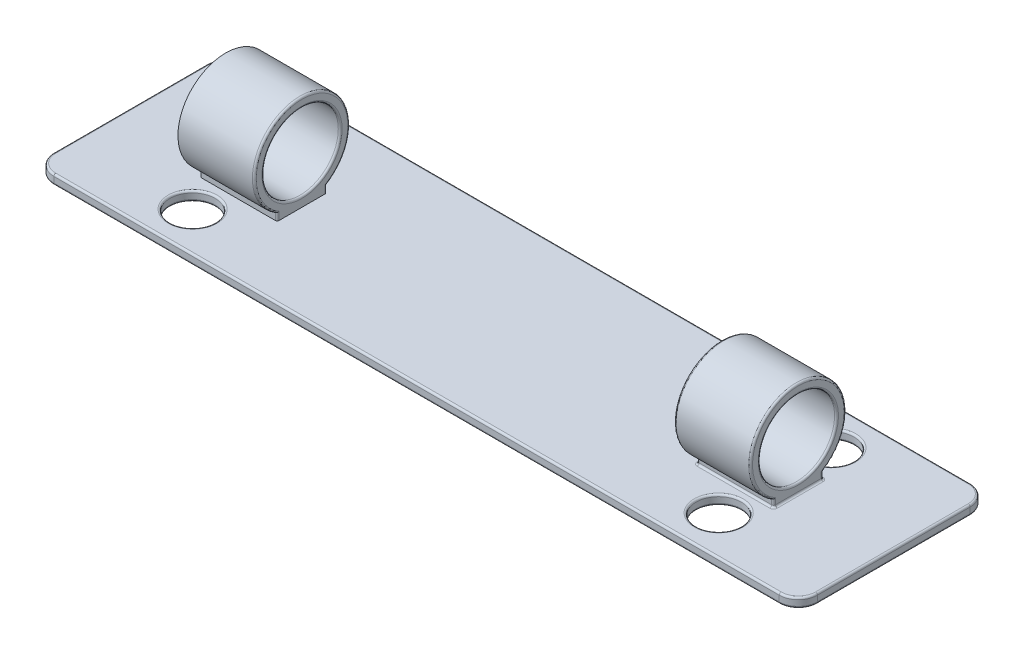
ISO-10303-21;
HEADER;
FILE_DESCRIPTION(('STEP AP214'),'2;1');
FILE_NAME('part.step','',(''),(''),'','','');
FILE_SCHEMA(('AUTOMOTIVE_DESIGN { 1 0 10303 214 1 1 1 1 }'));
ENDSEC;
DATA;
#1=APPLICATION_CONTEXT('core data for automotive mechanical design processes');
#2=APPLICATION_PROTOCOL_DEFINITION('international standard','automotive_design',2000,#1);
#3=PRODUCT_CONTEXT('',#1,'mechanical');
#4=PRODUCT('Part','Part','',(#3));
#5=PRODUCT_RELATED_PRODUCT_CATEGORY('part','',(#4));
#6=PRODUCT_DEFINITION_FORMATION('','',#4);
#7=PRODUCT_DEFINITION_CONTEXT('part definition',#1,'design');
#8=PRODUCT_DEFINITION('design','',#6,#7);
#9=PRODUCT_DEFINITION_SHAPE('','',#8);
#10=(LENGTH_UNIT() NAMED_UNIT(*) SI_UNIT(.MILLI.,.METRE.));
#11=(NAMED_UNIT(*) PLANE_ANGLE_UNIT() SI_UNIT($,.RADIAN.));
#12=(NAMED_UNIT(*) SI_UNIT($,.STERADIAN.) SOLID_ANGLE_UNIT());
#13=UNCERTAINTY_MEASURE_WITH_UNIT(LENGTH_MEASURE(1.E-05),#10,'distance_accuracy_value','');
#14=(GEOMETRIC_REPRESENTATION_CONTEXT(3) GLOBAL_UNCERTAINTY_ASSIGNED_CONTEXT((#13)) GLOBAL_UNIT_ASSIGNED_CONTEXT((#10,
#11,#12)) REPRESENTATION_CONTEXT('',''));
#15=CARTESIAN_POINT('',(0.,0.,0.));
#16=DIRECTION('',(0.,0.,1.));
#17=DIRECTION('',(1.,0.,0.));
#18=AXIS2_PLACEMENT_3D('',#15,#16,#17);
#19=CARTESIAN_POINT('',(0.,1.27,0.));
#20=DIRECTION('',(0.,1.,0.));
#21=DIRECTION('',(0.,0.,1.));
#22=AXIS2_PLACEMENT_3D('',#19,#20,#21);
#23=PLANE('',#22);
#24=DIRECTION('',(0.,0.,-1.));
#25=VECTOR('',#24,1.);
#26=CARTESIAN_POINT('',(-27.94,1.27,0.));
#27=LINE('',#26,#25);
#28=CARTESIAN_POINT('',(-27.94,1.27,3.048));
#29=VERTEX_POINT('',#28);
#30=CARTESIAN_POINT('',(-27.94,1.27,-3.048));
#31=VERTEX_POINT('',#30);
#32=EDGE_CURVE('E486',#29,#31,#27,.T.);
#33=ORIENTED_EDGE('',*,*,#32,.F.);
#34=CARTESIAN_POINT('',(-28.194,1.27,3.048));
#35=DIRECTION('',(0.,1.,0.));
#36=DIRECTION('',(0.,0.,1.));
#37=AXIS2_PLACEMENT_3D('',#34,#35,#36);
#38=CIRCLE('',#37,0.254);
#39=CARTESIAN_POINT('',(-28.194,1.27,3.302));
#40=VERTEX_POINT('',#39);
#41=EDGE_CURVE('E12',#29,#40,#38,.F.);
#42=ORIENTED_EDGE('',*,*,#41,.T.);
#43=DIRECTION('',(-1.,0.,0.));
#44=VECTOR('',#43,1.);
#45=CARTESIAN_POINT('',(0.,1.27,3.302));
#46=LINE('',#45,#44);
#47=CARTESIAN_POINT('',(-38.1,1.27,3.302));
#48=VERTEX_POINT('',#47);
#49=EDGE_CURVE('E489',#40,#48,#46,.T.);
#50=ORIENTED_EDGE('',*,*,#49,.T.);
#51=DIRECTION('',(0.,0.,-1.));
#52=VECTOR('',#51,1.);
#53=CARTESIAN_POINT('',(-38.1,1.27,0.));
#54=LINE('',#53,#52);
#55=CARTESIAN_POINT('',(-38.1,1.27,-3.302));
#56=VERTEX_POINT('',#55);
#57=EDGE_CURVE('E277',#48,#56,#54,.T.);
#58=ORIENTED_EDGE('',*,*,#57,.T.);
#59=DIRECTION('',(1.,0.,0.));
#60=VECTOR('',#59,1.);
#61=CARTESIAN_POINT('',(0.,1.27,-3.302));
#62=LINE('',#61,#60);
#63=CARTESIAN_POINT('',(-28.194,1.27,-3.302));
#64=VERTEX_POINT('',#63);
#65=EDGE_CURVE('E417',#56,#64,#62,.T.);
#66=ORIENTED_EDGE('',*,*,#65,.T.);
#67=CARTESIAN_POINT('',(-28.194,1.27,-3.048));
#68=DIRECTION('',(0.,1.,0.));
#69=DIRECTION('',(0.,0.,1.));
#70=AXIS2_PLACEMENT_3D('',#67,#68,#69);
#71=CIRCLE('',#70,0.254);
#72=EDGE_CURVE('E49',#64,#31,#71,.F.);
#73=ORIENTED_EDGE('',*,*,#72,.T.);
#74=EDGE_LOOP('',(#33,#42,#50,#58,#66,#73));
#75=FACE_BOUND('',#74,.T.);
#76=CARTESIAN_POINT('',(48.26,1.27,-10.16));
#77=DIRECTION('',(0.,1.,0.));
#78=DIRECTION('',(0.,0.,1.));
#79=AXIS2_PLACEMENT_3D('',#76,#77,#78);
#80=CIRCLE('',#79,2.286);
#81=CARTESIAN_POINT('',(48.26,1.27,-12.446));
#82=VERTEX_POINT('',#81);
#83=CARTESIAN_POINT('',(50.546,1.27,-10.16));
#84=VERTEX_POINT('',#83);
#85=EDGE_CURVE('E348',#82,#84,#80,.F.);
#86=ORIENTED_EDGE('',*,*,#85,.F.);
#87=DIRECTION('',(-1.,0.,0.));
#88=VECTOR('',#87,1.);
#89=CARTESIAN_POINT('',(-50.8,1.27,-12.446));
#90=LINE('',#89,#88);
#91=CARTESIAN_POINT('',(-48.26,1.27,-12.446));
#92=VERTEX_POINT('',#91);
#93=EDGE_CURVE('E345',#82,#92,#90,.T.);
#94=ORIENTED_EDGE('',*,*,#93,.T.);
#95=CARTESIAN_POINT('',(-48.26,1.27,-10.16));
#96=DIRECTION('',(0.,1.,0.));
#97=DIRECTION('',(0.,0.,1.));
#98=AXIS2_PLACEMENT_3D('',#95,#96,#97);
#99=CIRCLE('',#98,2.286);
#100=CARTESIAN_POINT('',(-50.546,1.27,-10.16));
#101=VERTEX_POINT('',#100);
#102=EDGE_CURVE('E343',#101,#92,#99,.F.);
#103=ORIENTED_EDGE('',*,*,#102,.F.);
#104=DIRECTION('',(0.,0.,1.));
#105=VECTOR('',#104,1.);
#106=CARTESIAN_POINT('',(-50.546,1.27,12.7));
#107=LINE('',#106,#105);
#108=CARTESIAN_POINT('',(-50.546,1.27,10.16));
#109=VERTEX_POINT('',#108);
#110=EDGE_CURVE('E339',#101,#109,#107,.T.);
#111=ORIENTED_EDGE('',*,*,#110,.T.);
#112=CARTESIAN_POINT('',(-48.26,1.27,10.16));
#113=DIRECTION('',(0.,1.,0.));
#114=DIRECTION('',(0.,0.,1.));
#115=AXIS2_PLACEMENT_3D('',#112,#113,#114);
#116=CIRCLE('',#115,2.286);
#117=CARTESIAN_POINT('',(-48.26,1.27,12.446));
#118=VERTEX_POINT('',#117);
#119=EDGE_CURVE('E336',#118,#109,#116,.F.);
#120=ORIENTED_EDGE('',*,*,#119,.F.);
#121=DIRECTION('',(1.,0.,0.));
#122=VECTOR('',#121,1.);
#123=CARTESIAN_POINT('',(50.8,1.27,12.446));
#124=LINE('',#123,#122);
#125=CARTESIAN_POINT('',(48.26,1.27,12.446));
#126=VERTEX_POINT('',#125);
#127=EDGE_CURVE('E334',#118,#126,#124,.T.);
#128=ORIENTED_EDGE('',*,*,#127,.T.);
#129=CARTESIAN_POINT('',(48.26,1.27,10.16));
#130=DIRECTION('',(0.,1.,0.));
#131=DIRECTION('',(0.,0.,1.));
#132=AXIS2_PLACEMENT_3D('',#129,#130,#131);
#133=CIRCLE('',#132,2.286);
#134=CARTESIAN_POINT('',(50.546,1.27,10.16));
#135=VERTEX_POINT('',#134);
#136=EDGE_CURVE('E331',#135,#126,#133,.F.);
#137=ORIENTED_EDGE('',*,*,#136,.F.);
#138=DIRECTION('',(0.,0.,-1.));
#139=VECTOR('',#138,1.);
#140=CARTESIAN_POINT('',(50.546,1.27,-12.7));
#141=LINE('',#140,#139);
#142=EDGE_CURVE('E341',#135,#84,#141,.T.);
#143=ORIENTED_EDGE('',*,*,#142,.T.);
#144=EDGE_LOOP('',(#86,#94,#103,#111,#120,#128,#137,#143));
#145=FACE_BOUND('',#144,.T.);
#146=CARTESIAN_POINT('',(-35.,1.27,-7.5));
#147=DIRECTION('',(0.,1.,0.));
#148=DIRECTION('',(0.,0.,1.));
#149=AXIS2_PLACEMENT_3D('',#146,#147,#148);
#150=CIRCLE('',#149,3.254);
#151=CARTESIAN_POINT('',(-35.,1.27,-4.246));
#152=VERTEX_POINT('',#151);
#153=EDGE_CURVE('E351',#152,#152,#150,.F.);
#154=ORIENTED_EDGE('',*,*,#153,.T.);
#155=EDGE_LOOP('',(#154));
#156=FACE_BOUND('',#155,.T.);
#157=CARTESIAN_POINT('',(-35.,1.27,7.5));
#158=DIRECTION('',(0.,1.,0.));
#159=DIRECTION('',(0.,0.,1.));
#160=AXIS2_PLACEMENT_3D('',#157,#158,#159);
#161=CIRCLE('',#160,3.254);
#162=CARTESIAN_POINT('',(-35.,1.27,10.754));
#163=VERTEX_POINT('',#162);
#164=EDGE_CURVE('E354',#163,#163,#161,.F.);
#165=ORIENTED_EDGE('',*,*,#164,.T.);
#166=EDGE_LOOP('',(#165));
#167=FACE_BOUND('',#166,.T.);
#168=CARTESIAN_POINT('',(35.,1.27,7.5));
#169=DIRECTION('',(0.,1.,0.));
#170=DIRECTION('',(0.,0.,1.));
#171=AXIS2_PLACEMENT_3D('',#168,#169,#170);
#172=CIRCLE('',#171,3.254);
#173=CARTESIAN_POINT('',(35.,1.27,10.754));
#174=VERTEX_POINT('',#173);
#175=EDGE_CURVE('E357',#174,#174,#172,.F.);
#176=ORIENTED_EDGE('',*,*,#175,.T.);
#177=EDGE_LOOP('',(#176));
#178=FACE_BOUND('',#177,.T.);
#179=CARTESIAN_POINT('',(35.,1.27,-7.5));
#180=DIRECTION('',(0.,1.,0.));
#181=DIRECTION('',(0.,0.,1.));
#182=AXIS2_PLACEMENT_3D('',#179,#180,#181);
#183=CIRCLE('',#182,3.254);
#184=CARTESIAN_POINT('',(35.,1.27,-4.246));
#185=VERTEX_POINT('',#184);
#186=EDGE_CURVE('E360',#185,#185,#183,.F.);
#187=ORIENTED_EDGE('',*,*,#186,.T.);
#188=EDGE_LOOP('',(#187));
#189=FACE_BOUND('',#188,.T.);
#190=CARTESIAN_POINT('',(28.194,1.27,3.048));
#191=DIRECTION('',(0.,1.,0.));
#192=DIRECTION('',(0.,0.,1.));
#193=AXIS2_PLACEMENT_3D('',#190,#191,#192);
#194=CIRCLE('',#193,0.508);
#195=CARTESIAN_POINT('',(27.686,1.27,3.048));
#196=VERTEX_POINT('',#195);
#197=CARTESIAN_POINT('',(28.194,1.27,3.556));
#198=VERTEX_POINT('',#197);
#199=EDGE_CURVE('E516',#196,#198,#194,.T.);
#200=ORIENTED_EDGE('',*,*,#199,.F.);
#201=DIRECTION('',(0.,0.,1.));
#202=VECTOR('',#201,1.);
#203=CARTESIAN_POINT('',(27.686,1.27,-3.302));
#204=LINE('',#203,#202);
#205=CARTESIAN_POINT('',(27.686,1.27,-3.048));
#206=VERTEX_POINT('',#205);
#207=EDGE_CURVE('E514',#196,#206,#204,.F.);
#208=ORIENTED_EDGE('',*,*,#207,.T.);
#209=CARTESIAN_POINT('',(28.194,1.27,-3.048));
#210=DIRECTION('',(0.,1.,0.));
#211=DIRECTION('',(0.,0.,1.));
#212=AXIS2_PLACEMENT_3D('',#209,#210,#211);
#213=CIRCLE('',#212,0.508);
#214=CARTESIAN_POINT('',(28.194,1.27,-3.556));
#215=VERTEX_POINT('',#214);
#216=EDGE_CURVE('E511',#215,#206,#213,.T.);
#217=ORIENTED_EDGE('',*,*,#216,.F.);
#218=DIRECTION('',(-1.,0.,0.));
#219=VECTOR('',#218,1.);
#220=CARTESIAN_POINT('',(38.1,1.27,-3.556));
#221=LINE('',#220,#219);
#222=CARTESIAN_POINT('',(37.846,1.27,-3.556));
#223=VERTEX_POINT('',#222);
#224=EDGE_CURVE('E506',#215,#223,#221,.F.);
#225=ORIENTED_EDGE('',*,*,#224,.T.);
#226=CARTESIAN_POINT('',(37.846,1.27,-3.048));
#227=DIRECTION('',(0.,1.,0.));
#228=DIRECTION('',(0.,0.,1.));
#229=AXIS2_PLACEMENT_3D('',#226,#227,#228);
#230=CIRCLE('',#229,0.508);
#231=CARTESIAN_POINT('',(38.354,1.27,-3.048));
#232=VERTEX_POINT('',#231);
#233=EDGE_CURVE('E503',#232,#223,#230,.T.);
#234=ORIENTED_EDGE('',*,*,#233,.F.);
#235=DIRECTION('',(0.,0.,1.));
#236=VECTOR('',#235,1.);
#237=CARTESIAN_POINT('',(38.354,1.27,0.));
#238=LINE('',#237,#236);
#239=CARTESIAN_POINT('',(38.354,1.27,3.048));
#240=VERTEX_POINT('',#239);
#241=EDGE_CURVE('E501',#232,#240,#238,.T.);
#242=ORIENTED_EDGE('',*,*,#241,.T.);
#243=CARTESIAN_POINT('',(37.846,1.27,3.048));
#244=DIRECTION('',(0.,1.,0.));
#245=DIRECTION('',(0.,0.,1.));
#246=AXIS2_PLACEMENT_3D('',#243,#244,#245);
#247=CIRCLE('',#246,0.508);
#248=CARTESIAN_POINT('',(37.846,1.27,3.556));
#249=VERTEX_POINT('',#248);
#250=EDGE_CURVE('E498',#249,#240,#247,.T.);
#251=ORIENTED_EDGE('',*,*,#250,.F.);
#252=DIRECTION('',(1.,0.,0.));
#253=VECTOR('',#252,1.);
#254=CARTESIAN_POINT('',(27.94,1.27,3.556));
#255=LINE('',#254,#253);
#256=EDGE_CURVE('E508',#249,#198,#255,.F.);
#257=ORIENTED_EDGE('',*,*,#256,.T.);
#258=EDGE_LOOP('',(#200,#208,#217,#225,#234,#242,#251,#257));
#259=FACE_BOUND('',#258,.T.);
#260=ADVANCED_FACE('F36',(#75,#145,#156,#167,#178,#189,#259),#23,.T.);
#261=CARTESIAN_POINT('',(0.,0.,0.));
#262=DIRECTION('',(0.,1.,0.));
#263=DIRECTION('',(0.,0.,1.));
#264=AXIS2_PLACEMENT_3D('',#261,#262,#263);
#265=PLANE('',#264);
#266=CARTESIAN_POINT('',(35.,0.,-7.5));
#267=DIRECTION('',(0.,1.,0.));
#268=DIRECTION('',(0.,0.,1.));
#269=AXIS2_PLACEMENT_3D('',#266,#267,#268);
#270=CIRCLE('',#269,3.254);
#271=CARTESIAN_POINT('',(35.,0.,-4.246));
#272=VERTEX_POINT('',#271);
#273=EDGE_CURVE('E322',#272,#272,#270,.T.);
#274=ORIENTED_EDGE('',*,*,#273,.T.);
#275=EDGE_LOOP('',(#274));
#276=FACE_BOUND('',#275,.T.);
#277=CARTESIAN_POINT('',(35.,0.,7.5));
#278=DIRECTION('',(0.,1.,0.));
#279=DIRECTION('',(0.,0.,1.));
#280=AXIS2_PLACEMENT_3D('',#277,#278,#279);
#281=CIRCLE('',#280,3.254);
#282=CARTESIAN_POINT('',(35.,0.,10.754));
#283=VERTEX_POINT('',#282);
#284=EDGE_CURVE('E319',#283,#283,#281,.T.);
#285=ORIENTED_EDGE('',*,*,#284,.T.);
#286=EDGE_LOOP('',(#285));
#287=FACE_BOUND('',#286,.T.);
#288=CARTESIAN_POINT('',(-35.,0.,-7.5));
#289=DIRECTION('',(0.,1.,0.));
#290=DIRECTION('',(0.,0.,1.));
#291=AXIS2_PLACEMENT_3D('',#288,#289,#290);
#292=CIRCLE('',#291,3.254);
#293=CARTESIAN_POINT('',(-35.,0.,-4.246));
#294=VERTEX_POINT('',#293);
#295=EDGE_CURVE('E316',#294,#294,#292,.T.);
#296=ORIENTED_EDGE('',*,*,#295,.T.);
#297=EDGE_LOOP('',(#296));
#298=FACE_BOUND('',#297,.T.);
#299=CARTESIAN_POINT('',(-35.,0.,7.5));
#300=DIRECTION('',(0.,1.,0.));
#301=DIRECTION('',(0.,0.,1.));
#302=AXIS2_PLACEMENT_3D('',#299,#300,#301);
#303=CIRCLE('',#302,3.254);
#304=CARTESIAN_POINT('',(-35.,0.,10.754));
#305=VERTEX_POINT('',#304);
#306=EDGE_CURVE('E313',#305,#305,#303,.T.);
#307=ORIENTED_EDGE('',*,*,#306,.T.);
#308=EDGE_LOOP('',(#307));
#309=FACE_BOUND('',#308,.T.);
#310=CARTESIAN_POINT('',(-48.26,0.,10.16));
#311=DIRECTION('',(0.,1.,0.));
#312=DIRECTION('',(0.,0.,1.));
#313=AXIS2_PLACEMENT_3D('',#310,#311,#312);
#314=CIRCLE('',#313,2.286);
#315=CARTESIAN_POINT('',(-50.546,0.,10.16));
#316=VERTEX_POINT('',#315);
#317=CARTESIAN_POINT('',(-48.26,0.,12.446));
#318=VERTEX_POINT('',#317);
#319=EDGE_CURVE('E291',#316,#318,#314,.T.);
#320=ORIENTED_EDGE('',*,*,#319,.F.);
#321=DIRECTION('',(0.,0.,1.));
#322=VECTOR('',#321,1.);
#323=CARTESIAN_POINT('',(-50.546,0.,0.));
#324=LINE('',#323,#322);
#325=CARTESIAN_POINT('',(-50.546,0.,-10.16));
#326=VERTEX_POINT('',#325);
#327=EDGE_CURVE('E310',#316,#326,#324,.F.);
#328=ORIENTED_EDGE('',*,*,#327,.T.);
#329=CARTESIAN_POINT('',(-48.26,0.,-10.16));
#330=DIRECTION('',(0.,1.,0.));
#331=DIRECTION('',(0.,0.,1.));
#332=AXIS2_PLACEMENT_3D('',#329,#330,#331);
#333=CIRCLE('',#332,2.286);
#334=CARTESIAN_POINT('',(-48.26,0.,-12.446));
#335=VERTEX_POINT('',#334);
#336=EDGE_CURVE('E307',#335,#326,#333,.T.);
#337=ORIENTED_EDGE('',*,*,#336,.F.);
#338=DIRECTION('',(-1.,0.,0.));
#339=VECTOR('',#338,1.);
#340=CARTESIAN_POINT('',(0.,0.,-12.446));
#341=LINE('',#340,#339);
#342=CARTESIAN_POINT('',(48.26,0.,-12.446));
#343=VERTEX_POINT('',#342);
#344=EDGE_CURVE('E305',#335,#343,#341,.F.);
#345=ORIENTED_EDGE('',*,*,#344,.T.);
#346=CARTESIAN_POINT('',(48.26,0.,-10.16));
#347=DIRECTION('',(0.,1.,0.));
#348=DIRECTION('',(0.,0.,1.));
#349=AXIS2_PLACEMENT_3D('',#346,#347,#348);
#350=CIRCLE('',#349,2.286);
#351=CARTESIAN_POINT('',(50.546,0.,-10.16));
#352=VERTEX_POINT('',#351);
#353=EDGE_CURVE('E302',#352,#343,#350,.T.);
#354=ORIENTED_EDGE('',*,*,#353,.F.);
#355=DIRECTION('',(0.,0.,-1.));
#356=VECTOR('',#355,1.);
#357=CARTESIAN_POINT('',(50.546,0.,0.));
#358=LINE('',#357,#356);
#359=CARTESIAN_POINT('',(50.546,0.,10.16));
#360=VERTEX_POINT('',#359);
#361=EDGE_CURVE('E300',#352,#360,#358,.F.);
#362=ORIENTED_EDGE('',*,*,#361,.T.);
#363=CARTESIAN_POINT('',(48.26,0.,10.16));
#364=DIRECTION('',(0.,1.,0.));
#365=DIRECTION('',(0.,0.,1.));
#366=AXIS2_PLACEMENT_3D('',#363,#364,#365);
#367=CIRCLE('',#366,2.286);
#368=CARTESIAN_POINT('',(48.26,0.,12.446));
#369=VERTEX_POINT('',#368);
#370=EDGE_CURVE('E297',#369,#360,#367,.T.);
#371=ORIENTED_EDGE('',*,*,#370,.F.);
#372=DIRECTION('',(1.,0.,0.));
#373=VECTOR('',#372,1.);
#374=CARTESIAN_POINT('',(0.,0.,12.446));
#375=LINE('',#374,#373);
#376=EDGE_CURVE('E294',#369,#318,#375,.F.);
#377=ORIENTED_EDGE('',*,*,#376,.T.);
#378=EDGE_LOOP('',(#320,#328,#337,#345,#354,#362,#371,#377));
#379=FACE_BOUND('',#378,.T.);
#380=ADVANCED_FACE('F773',(#276,#287,#298,#309,#379),#265,.F.);
#381=CARTESIAN_POINT('',(50.8,1.27,-12.7));
#382=DIRECTION('',(-1.,0.,0.));
#383=DIRECTION('',(0.,0.,1.));
#384=AXIS2_PLACEMENT_3D('',#381,#382,#383);
#385=PLANE('',#384);
#386=DIRECTION('',(0.,0.,-1.));
#387=VECTOR('',#386,1.);
#388=CARTESIAN_POINT('',(50.8,0.254,-12.7));
#389=LINE('',#388,#387);
#390=CARTESIAN_POINT('',(50.8,0.254,10.16));
#391=VERTEX_POINT('',#390);
#392=CARTESIAN_POINT('',(50.8,0.254,-10.16));
#393=VERTEX_POINT('',#392);
#394=EDGE_CURVE('E403',#391,#393,#389,.T.);
#395=ORIENTED_EDGE('',*,*,#394,.T.);
#396=DIRECTION('',(0.,-1.,0.));
#397=VECTOR('',#396,1.);
#398=CARTESIAN_POINT('',(50.8,1.27,-10.16));
#399=LINE('',#398,#397);
#400=CARTESIAN_POINT('',(50.8,1.016,-10.16));
#401=VERTEX_POINT('',#400);
#402=EDGE_CURVE('E406',#393,#401,#399,.F.);
#403=ORIENTED_EDGE('',*,*,#402,.T.);
#404=DIRECTION('',(0.,0.,-1.));
#405=VECTOR('',#404,1.);
#406=CARTESIAN_POINT('',(50.8,1.016,12.7));
#407=LINE('',#406,#405);
#408=CARTESIAN_POINT('',(50.8,1.016,10.16));
#409=VERTEX_POINT('',#408);
#410=EDGE_CURVE('E401',#401,#409,#407,.F.);
#411=ORIENTED_EDGE('',*,*,#410,.T.);
#412=DIRECTION('',(0.,-1.,0.));
#413=VECTOR('',#412,1.);
#414=CARTESIAN_POINT('',(50.8,1.27,10.16));
#415=LINE('',#414,#413);
#416=EDGE_CURVE('E399',#409,#391,#415,.T.);
#417=ORIENTED_EDGE('',*,*,#416,.T.);
#418=EDGE_LOOP('',(#395,#403,#411,#417));
#419=FACE_BOUND('',#418,.T.);
#420=ADVANCED_FACE('F781',(#419),#385,.F.);
#421=CARTESIAN_POINT('',(-50.8,1.27,-12.7));
#422=DIRECTION('',(0.,0.,1.));
#423=DIRECTION('',(1.,0.,0.));
#424=AXIS2_PLACEMENT_3D('',#421,#422,#423);
#425=PLANE('',#424);
#426=DIRECTION('',(-1.,0.,0.));
#427=VECTOR('',#426,1.);
#428=CARTESIAN_POINT('',(-50.8,0.254,-12.7));
#429=LINE('',#428,#427);
#430=CARTESIAN_POINT('',(48.26,0.254,-12.7));
#431=VERTEX_POINT('',#430);
#432=CARTESIAN_POINT('',(-48.26,0.254,-12.7));
#433=VERTEX_POINT('',#432);
#434=EDGE_CURVE('E394',#431,#433,#429,.T.);
#435=ORIENTED_EDGE('',*,*,#434,.T.);
#436=DIRECTION('',(0.,-1.,0.));
#437=VECTOR('',#436,1.);
#438=CARTESIAN_POINT('',(-48.26,1.27,-12.7));
#439=LINE('',#438,#437);
#440=CARTESIAN_POINT('',(-48.26,1.016,-12.7));
#441=VERTEX_POINT('',#440);
#442=EDGE_CURVE('E397',#433,#441,#439,.F.);
#443=ORIENTED_EDGE('',*,*,#442,.T.);
#444=DIRECTION('',(-1.,0.,0.));
#445=VECTOR('',#444,1.);
#446=CARTESIAN_POINT('',(50.8,1.016,-12.7));
#447=LINE('',#446,#445);
#448=CARTESIAN_POINT('',(48.26,1.016,-12.7));
#449=VERTEX_POINT('',#448);
#450=EDGE_CURVE('E392',#441,#449,#447,.F.);
#451=ORIENTED_EDGE('',*,*,#450,.T.);
#452=DIRECTION('',(0.,-1.,0.));
#453=VECTOR('',#452,1.);
#454=CARTESIAN_POINT('',(48.26,1.27,-12.7));
#455=LINE('',#454,#453);
#456=EDGE_CURVE('E390',#449,#431,#455,.T.);
#457=ORIENTED_EDGE('',*,*,#456,.T.);
#458=EDGE_LOOP('',(#435,#443,#451,#457));
#459=FACE_BOUND('',#458,.T.);
#460=ADVANCED_FACE('F797',(#459),#425,.F.);
#461=CARTESIAN_POINT('',(-50.8,1.27,-12.7));
#462=DIRECTION('',(1.,0.,0.));
#463=DIRECTION('',(0.,0.,-1.));
#464=AXIS2_PLACEMENT_3D('',#461,#462,#463);
#465=PLANE('',#464);
#466=DIRECTION('',(0.,0.,1.));
#467=VECTOR('',#466,1.);
#468=CARTESIAN_POINT('',(-50.8,1.016,-12.7));
#469=LINE('',#468,#467);
#470=CARTESIAN_POINT('',(-50.8,1.016,10.16));
#471=VERTEX_POINT('',#470);
#472=CARTESIAN_POINT('',(-50.8,1.016,-10.16));
#473=VERTEX_POINT('',#472);
#474=EDGE_CURVE('E383',#471,#473,#469,.F.);
#475=ORIENTED_EDGE('',*,*,#474,.T.);
#476=DIRECTION('',(0.,-1.,0.));
#477=VECTOR('',#476,1.);
#478=CARTESIAN_POINT('',(-50.8,1.27,-10.16));
#479=LINE('',#478,#477);
#480=CARTESIAN_POINT('',(-50.8,0.254,-10.16));
#481=VERTEX_POINT('',#480);
#482=EDGE_CURVE('E388',#473,#481,#479,.T.);
#483=ORIENTED_EDGE('',*,*,#482,.T.);
#484=DIRECTION('',(0.,0.,1.));
#485=VECTOR('',#484,1.);
#486=CARTESIAN_POINT('',(-50.8,0.254,-12.7));
#487=LINE('',#486,#485);
#488=CARTESIAN_POINT('',(-50.8,0.254,10.16));
#489=VERTEX_POINT('',#488);
#490=EDGE_CURVE('E385',#481,#489,#487,.T.);
#491=ORIENTED_EDGE('',*,*,#490,.T.);
#492=DIRECTION('',(0.,-1.,0.));
#493=VECTOR('',#492,1.);
#494=CARTESIAN_POINT('',(-50.8,1.27,10.16));
#495=LINE('',#494,#493);
#496=EDGE_CURVE('E381',#489,#471,#495,.F.);
#497=ORIENTED_EDGE('',*,*,#496,.T.);
#498=EDGE_LOOP('',(#475,#483,#491,#497));
#499=FACE_BOUND('',#498,.T.);
#500=ADVANCED_FACE('F793',(#499),#465,.F.);
#501=CARTESIAN_POINT('',(-50.8,1.27,12.7));
#502=DIRECTION('',(0.,0.,-1.));
#503=DIRECTION('',(-1.,0.,0.));
#504=AXIS2_PLACEMENT_3D('',#501,#502,#503);
#505=PLANE('',#504);
#506=DIRECTION('',(1.,0.,0.));
#507=VECTOR('',#506,1.);
#508=CARTESIAN_POINT('',(-50.8,0.254,12.7));
#509=LINE('',#508,#507);
#510=CARTESIAN_POINT('',(-48.26,0.254,12.7));
#511=VERTEX_POINT('',#510);
#512=CARTESIAN_POINT('',(48.26,0.254,12.7));
#513=VERTEX_POINT('',#512);
#514=EDGE_CURVE('E412',#511,#513,#509,.T.);
#515=ORIENTED_EDGE('',*,*,#514,.T.);
#516=DIRECTION('',(0.,-1.,0.));
#517=VECTOR('',#516,1.);
#518=CARTESIAN_POINT('',(48.26,1.27,12.7));
#519=LINE('',#518,#517);
#520=CARTESIAN_POINT('',(48.26,1.016,12.7));
#521=VERTEX_POINT('',#520);
#522=EDGE_CURVE('E415',#513,#521,#519,.F.);
#523=ORIENTED_EDGE('',*,*,#522,.T.);
#524=DIRECTION('',(1.,0.,0.));
#525=VECTOR('',#524,1.);
#526=CARTESIAN_POINT('',(-50.8,1.016,12.7));
#527=LINE('',#526,#525);
#528=CARTESIAN_POINT('',(-48.26,1.016,12.7));
#529=VERTEX_POINT('',#528);
#530=EDGE_CURVE('E410',#521,#529,#527,.F.);
#531=ORIENTED_EDGE('',*,*,#530,.T.);
#532=DIRECTION('',(0.,-1.,0.));
#533=VECTOR('',#532,1.);
#534=CARTESIAN_POINT('',(-48.26,1.27,12.7));
#535=LINE('',#534,#533);
#536=EDGE_CURVE('E408',#529,#511,#535,.T.);
#537=ORIENTED_EDGE('',*,*,#536,.T.);
#538=EDGE_LOOP('',(#515,#523,#531,#537));
#539=FACE_BOUND('',#538,.T.);
#540=ADVANCED_FACE('F790',(#539),#505,.F.);
#541=CARTESIAN_POINT('',(-35.,1.27,-7.5));
#542=DIRECTION('',(0.,-1.,0.));
#543=DIRECTION('',(0.,0.,-1.));
#544=AXIS2_PLACEMENT_3D('',#541,#542,#543);
#545=CYLINDRICAL_SURFACE('',#544,3.);
#546=CARTESIAN_POINT('',(-35.,0.254,-7.5));
#547=DIRECTION('',(0.,1.,0.));
#548=DIRECTION('',(0.,0.,1.));
#549=AXIS2_PLACEMENT_3D('',#546,#547,#548);
#550=CIRCLE('',#549,3.);
#551=CARTESIAN_POINT('',(-35.,0.254,-4.5));
#552=VERTEX_POINT('',#551);
#553=EDGE_CURVE('E372',#552,#552,#550,.F.);
#554=ORIENTED_EDGE('',*,*,#553,.T.);
#555=EDGE_LOOP('',(#554));
#556=FACE_BOUND('',#555,.T.);
#557=CARTESIAN_POINT('',(-35.,1.016,-7.5));
#558=DIRECTION('',(0.,1.,0.));
#559=DIRECTION('',(0.,0.,1.));
#560=AXIS2_PLACEMENT_3D('',#557,#558,#559);
#561=CIRCLE('',#560,3.);
#562=CARTESIAN_POINT('',(-35.,1.016,-4.5));
#563=VERTEX_POINT('',#562);
#564=EDGE_CURVE('E369',#563,#563,#561,.T.);
#565=ORIENTED_EDGE('',*,*,#564,.T.);
#566=EDGE_LOOP('',(#565));
#567=FACE_BOUND('',#566,.T.);
#568=ADVANCED_FACE('F787',(#556,#567),#545,.F.);
#569=CARTESIAN_POINT('',(-35.,1.27,7.5));
#570=DIRECTION('',(0.,-1.,0.));
#571=DIRECTION('',(0.,0.,-1.));
#572=AXIS2_PLACEMENT_3D('',#569,#570,#571);
#573=CYLINDRICAL_SURFACE('',#572,3.);
#574=CARTESIAN_POINT('',(-35.,1.016,7.5));
#575=DIRECTION('',(0.,1.,0.));
#576=DIRECTION('',(0.,0.,1.));
#577=AXIS2_PLACEMENT_3D('',#574,#575,#576);
#578=CIRCLE('',#577,3.);
#579=CARTESIAN_POINT('',(-35.,1.016,10.5));
#580=VERTEX_POINT('',#579);
#581=EDGE_CURVE('E378',#580,#580,#578,.T.);
#582=ORIENTED_EDGE('',*,*,#581,.T.);
#583=EDGE_LOOP('',(#582));
#584=FACE_BOUND('',#583,.T.);
#585=CARTESIAN_POINT('',(-35.,0.254,7.5));
#586=DIRECTION('',(0.,1.,0.));
#587=DIRECTION('',(0.,0.,1.));
#588=AXIS2_PLACEMENT_3D('',#585,#586,#587);
#589=CIRCLE('',#588,3.);
#590=CARTESIAN_POINT('',(-35.,0.254,10.5));
#591=VERTEX_POINT('',#590);
#592=EDGE_CURVE('E375',#591,#591,#589,.F.);
#593=ORIENTED_EDGE('',*,*,#592,.T.);
#594=EDGE_LOOP('',(#593));
#595=FACE_BOUND('',#594,.T.);
#596=ADVANCED_FACE('F987',(#584,#595),#573,.F.);
#597=CARTESIAN_POINT('',(35.,1.27,7.5));
#598=DIRECTION('',(0.,-1.,0.));
#599=DIRECTION('',(0.,0.,-1.));
#600=AXIS2_PLACEMENT_3D('',#597,#598,#599);
#601=CYLINDRICAL_SURFACE('',#600,3.);
#602=CARTESIAN_POINT('',(35.,0.254,7.5));
#603=DIRECTION('',(0.,1.,0.));
#604=DIRECTION('',(0.,0.,1.));
#605=AXIS2_PLACEMENT_3D('',#602,#603,#604);
#606=CIRCLE('',#605,3.);
#607=CARTESIAN_POINT('',(35.,0.254,10.5));
#608=VERTEX_POINT('',#607);
#609=EDGE_CURVE('E366',#608,#608,#606,.F.);
#610=ORIENTED_EDGE('',*,*,#609,.T.);
#611=EDGE_LOOP('',(#610));
#612=FACE_BOUND('',#611,.T.);
#613=CARTESIAN_POINT('',(35.,1.016,7.5));
#614=DIRECTION('',(0.,1.,0.));
#615=DIRECTION('',(0.,0.,1.));
#616=AXIS2_PLACEMENT_3D('',#613,#614,#615);
#617=CIRCLE('',#616,3.);
#618=CARTESIAN_POINT('',(35.,1.016,10.5));
#619=VERTEX_POINT('',#618);
#620=EDGE_CURVE('E363',#619,#619,#617,.T.);
#621=ORIENTED_EDGE('',*,*,#620,.T.);
#622=EDGE_LOOP('',(#621));
#623=FACE_BOUND('',#622,.T.);
#624=ADVANCED_FACE('F981',(#612,#623),#601,.F.);
#625=CARTESIAN_POINT('',(35.,1.27,-7.5));
#626=DIRECTION('',(0.,-1.,0.));
#627=DIRECTION('',(0.,0.,-1.));
#628=AXIS2_PLACEMENT_3D('',#625,#626,#627);
#629=CYLINDRICAL_SURFACE('',#628,3.);
#630=CARTESIAN_POINT('',(35.,0.254,-7.5));
#631=DIRECTION('',(0.,1.,0.));
#632=DIRECTION('',(0.,0.,1.));
#633=AXIS2_PLACEMENT_3D('',#630,#631,#632);
#634=CIRCLE('',#633,3.);
#635=CARTESIAN_POINT('',(35.,0.254,-4.5));
#636=VERTEX_POINT('',#635);
#637=EDGE_CURVE('E328',#636,#636,#634,.F.);
#638=ORIENTED_EDGE('',*,*,#637,.T.);
#639=EDGE_LOOP('',(#638));
#640=FACE_BOUND('',#639,.T.);
#641=CARTESIAN_POINT('',(35.,1.016,-7.5));
#642=DIRECTION('',(0.,1.,0.));
#643=DIRECTION('',(0.,0.,1.));
#644=AXIS2_PLACEMENT_3D('',#641,#642,#643);
#645=CIRCLE('',#644,3.);
#646=CARTESIAN_POINT('',(35.,1.016,-4.5));
#647=VERTEX_POINT('',#646);
#648=EDGE_CURVE('E325',#647,#647,#645,.T.);
#649=ORIENTED_EDGE('',*,*,#648,.T.);
#650=EDGE_LOOP('',(#649));
#651=FACE_BOUND('',#650,.T.);
#652=ADVANCED_FACE('F809',(#640,#651),#629,.F.);
#653=CARTESIAN_POINT('',(35.,0.254,-7.5));
#654=DIRECTION('',(0.,1.,0.));
#655=DIRECTION('',(0.,0.,1.));
#656=AXIS2_PLACEMENT_3D('',#653,#654,#655);
#657=TOROIDAL_SURFACE('',#656,3.254,0.254);
#658=ORIENTED_EDGE('',*,*,#637,.F.);
#659=EDGE_LOOP('',(#658));
#660=FACE_BOUND('',#659,.T.);
#661=ORIENTED_EDGE('',*,*,#273,.F.);
#662=EDGE_LOOP('',(#661));
#663=FACE_BOUND('',#662,.T.);
#664=ADVANCED_FACE('F805',(#660,#663),#657,.T.);
#665=CARTESIAN_POINT('',(35.,1.016,-7.5));
#666=DIRECTION('',(0.,1.,0.));
#667=DIRECTION('',(0.,0.,1.));
#668=AXIS2_PLACEMENT_3D('',#665,#666,#667);
#669=TOROIDAL_SURFACE('',#668,3.254,0.254);
#670=ORIENTED_EDGE('',*,*,#186,.F.);
#671=EDGE_LOOP('',(#670));
#672=FACE_BOUND('',#671,.T.);
#673=ORIENTED_EDGE('',*,*,#648,.F.);
#674=EDGE_LOOP('',(#673));
#675=FACE_BOUND('',#674,.T.);
#676=ADVANCED_FACE('F808',(#672,#675),#669,.T.);
#677=CARTESIAN_POINT('',(35.,0.254,7.5));
#678=DIRECTION('',(0.,1.,0.));
#679=DIRECTION('',(0.,0.,1.));
#680=AXIS2_PLACEMENT_3D('',#677,#678,#679);
#681=TOROIDAL_SURFACE('',#680,3.254,0.254);
#682=ORIENTED_EDGE('',*,*,#609,.F.);
#683=EDGE_LOOP('',(#682));
#684=FACE_BOUND('',#683,.T.);
#685=ORIENTED_EDGE('',*,*,#284,.F.);
#686=EDGE_LOOP('',(#685));
#687=FACE_BOUND('',#686,.T.);
#688=ADVANCED_FACE('F813',(#684,#687),#681,.T.);
#689=CARTESIAN_POINT('',(35.,1.016,7.5));
#690=DIRECTION('',(0.,1.,0.));
#691=DIRECTION('',(0.,0.,1.));
#692=AXIS2_PLACEMENT_3D('',#689,#690,#691);
#693=TOROIDAL_SURFACE('',#692,3.254,0.254);
#694=ORIENTED_EDGE('',*,*,#175,.F.);
#695=EDGE_LOOP('',(#694));
#696=FACE_BOUND('',#695,.T.);
#697=ORIENTED_EDGE('',*,*,#620,.F.);
#698=EDGE_LOOP('',(#697));
#699=FACE_BOUND('',#698,.T.);
#700=ADVANCED_FACE('F817',(#696,#699),#693,.T.);
#701=CARTESIAN_POINT('',(-35.,0.254,-7.5));
#702=DIRECTION('',(0.,1.,0.));
#703=DIRECTION('',(0.,0.,1.));
#704=AXIS2_PLACEMENT_3D('',#701,#702,#703);
#705=TOROIDAL_SURFACE('',#704,3.254,0.254);
#706=ORIENTED_EDGE('',*,*,#553,.F.);
#707=EDGE_LOOP('',(#706));
#708=FACE_BOUND('',#707,.T.);
#709=ORIENTED_EDGE('',*,*,#295,.F.);
#710=EDGE_LOOP('',(#709));
#711=FACE_BOUND('',#710,.T.);
#712=ADVANCED_FACE('F821',(#708,#711),#705,.T.);
#713=CARTESIAN_POINT('',(-35.,1.016,7.5));
#714=DIRECTION('',(0.,1.,0.));
#715=DIRECTION('',(0.,0.,1.));
#716=AXIS2_PLACEMENT_3D('',#713,#714,#715);
#717=TOROIDAL_SURFACE('',#716,3.254,0.254);
#718=ORIENTED_EDGE('',*,*,#164,.F.);
#719=EDGE_LOOP('',(#718));
#720=FACE_BOUND('',#719,.T.);
#721=ORIENTED_EDGE('',*,*,#581,.F.);
#722=EDGE_LOOP('',(#721));
#723=FACE_BOUND('',#722,.T.);
#724=ADVANCED_FACE('F825',(#720,#723),#717,.T.);
#725=CARTESIAN_POINT('',(-35.,0.254,7.5));
#726=DIRECTION('',(0.,1.,0.));
#727=DIRECTION('',(0.,0.,1.));
#728=AXIS2_PLACEMENT_3D('',#725,#726,#727);
#729=TOROIDAL_SURFACE('',#728,3.254,0.254);
#730=ORIENTED_EDGE('',*,*,#592,.F.);
#731=EDGE_LOOP('',(#730));
#732=FACE_BOUND('',#731,.T.);
#733=ORIENTED_EDGE('',*,*,#306,.F.);
#734=EDGE_LOOP('',(#733));
#735=FACE_BOUND('',#734,.T.);
#736=ADVANCED_FACE('F829',(#732,#735),#729,.T.);
#737=CARTESIAN_POINT('',(-35.,1.016,-7.5));
#738=DIRECTION('',(0.,1.,0.));
#739=DIRECTION('',(0.,0.,1.));
#740=AXIS2_PLACEMENT_3D('',#737,#738,#739);
#741=TOROIDAL_SURFACE('',#740,3.254,0.254);
#742=ORIENTED_EDGE('',*,*,#153,.F.);
#743=EDGE_LOOP('',(#742));
#744=FACE_BOUND('',#743,.T.);
#745=ORIENTED_EDGE('',*,*,#564,.F.);
#746=EDGE_LOOP('',(#745));
#747=FACE_BOUND('',#746,.T.);
#748=ADVANCED_FACE('F833',(#744,#747),#741,.T.);
#749=CARTESIAN_POINT('',(50.546,1.016,0.));
#750=DIRECTION('',(0.,0.,1.));
#751=DIRECTION('',(1.,0.,0.));
#752=AXIS2_PLACEMENT_3D('',#749,#750,#751);
#753=CYLINDRICAL_SURFACE('',#752,0.254);
#754=CARTESIAN_POINT('',(50.546,1.016,-10.16));
#755=DIRECTION('',(0.,0.,-1.));
#756=DIRECTION('',(-1.,0.,0.));
#757=AXIS2_PLACEMENT_3D('',#754,#755,#756);
#758=CIRCLE('',#757,0.254);
#759=EDGE_CURVE('E295',#84,#401,#758,.T.);
#760=ORIENTED_EDGE('',*,*,#759,.F.);
#761=ORIENTED_EDGE('',*,*,#142,.F.);
#762=CARTESIAN_POINT('',(50.546,1.016,10.16));
#763=DIRECTION('',(0.,0.,1.));
#764=DIRECTION('',(1.,0.,0.));
#765=AXIS2_PLACEMENT_3D('',#762,#763,#764);
#766=CIRCLE('',#765,0.254);
#767=EDGE_CURVE('E478',#409,#135,#766,.T.);
#768=ORIENTED_EDGE('',*,*,#767,.F.);
#769=ORIENTED_EDGE('',*,*,#410,.F.);
#770=EDGE_LOOP('',(#760,#761,#768,#769));
#771=FACE_BOUND('',#770,.T.);
#772=ADVANCED_FACE('F837',(#771),#753,.T.);
#773=CARTESIAN_POINT('',(48.26,1.016,-10.16));
#774=DIRECTION('',(0.,1.,0.));
#775=DIRECTION('',(0.,0.,1.));
#776=AXIS2_PLACEMENT_3D('',#773,#774,#775);
#777=TOROIDAL_SURFACE('',#776,2.286,0.254);
#778=ORIENTED_EDGE('',*,*,#85,.T.);
#779=ORIENTED_EDGE('',*,*,#759,.T.);
#780=CARTESIAN_POINT('',(48.26,1.016,-10.16));
#781=DIRECTION('',(0.,1.,0.));
#782=DIRECTION('',(0.,0.,1.));
#783=AXIS2_PLACEMENT_3D('',#780,#781,#782);
#784=CIRCLE('',#783,2.54);
#785=EDGE_CURVE('E475',#449,#401,#784,.F.);
#786=ORIENTED_EDGE('',*,*,#785,.F.);
#787=CARTESIAN_POINT('',(48.26,1.016,-12.446));
#788=DIRECTION('',(1.,0.,0.));
#789=DIRECTION('',(0.,0.,-1.));
#790=AXIS2_PLACEMENT_3D('',#787,#788,#789);
#791=CIRCLE('',#790,0.254);
#792=EDGE_CURVE('E472',#82,#449,#791,.F.);
#793=ORIENTED_EDGE('',*,*,#792,.F.);
#794=EDGE_LOOP('',(#778,#779,#786,#793));
#795=FACE_BOUND('',#794,.T.);
#796=ADVANCED_FACE('F911',(#795),#777,.T.);
#797=CARTESIAN_POINT('',(48.26,1.016,10.16));
#798=DIRECTION('',(0.,1.,0.));
#799=DIRECTION('',(0.,0.,1.));
#800=AXIS2_PLACEMENT_3D('',#797,#798,#799);
#801=TOROIDAL_SURFACE('',#800,2.286,0.254);
#802=ORIENTED_EDGE('',*,*,#767,.T.);
#803=ORIENTED_EDGE('',*,*,#136,.T.);
#804=CARTESIAN_POINT('',(48.26,1.016,12.446));
#805=DIRECTION('',(1.,0.,0.));
#806=DIRECTION('',(0.,0.,-1.));
#807=AXIS2_PLACEMENT_3D('',#804,#805,#806);
#808=CIRCLE('',#807,0.254);
#809=EDGE_CURVE('E469',#521,#126,#808,.F.);
#810=ORIENTED_EDGE('',*,*,#809,.F.);
#811=CARTESIAN_POINT('',(48.26,1.016,10.16));
#812=DIRECTION('',(0.,1.,0.));
#813=DIRECTION('',(0.,0.,1.));
#814=AXIS2_PLACEMENT_3D('',#811,#812,#813);
#815=CIRCLE('',#814,2.54);
#816=EDGE_CURVE('E466',#409,#521,#815,.F.);
#817=ORIENTED_EDGE('',*,*,#816,.F.);
#818=EDGE_LOOP('',(#802,#803,#810,#817));
#819=FACE_BOUND('',#818,.T.);
#820=ADVANCED_FACE('F907',(#819),#801,.T.);
#821=CARTESIAN_POINT('',(48.26,1.27,-10.16));
#822=DIRECTION('',(0.,-1.,0.));
#823=DIRECTION('',(0.,0.,-1.));
#824=AXIS2_PLACEMENT_3D('',#821,#822,#823);
#825=CYLINDRICAL_SURFACE('',#824,2.54);
#826=ORIENTED_EDGE('',*,*,#785,.T.);
#827=ORIENTED_EDGE('',*,*,#402,.F.);
#828=CARTESIAN_POINT('',(48.26,0.254,-10.16));
#829=DIRECTION('',(0.,1.,0.));
#830=DIRECTION('',(0.,0.,1.));
#831=AXIS2_PLACEMENT_3D('',#828,#829,#830);
#832=CIRCLE('',#831,2.54);
#833=EDGE_CURVE('E461',#431,#393,#832,.F.);
#834=ORIENTED_EDGE('',*,*,#833,.F.);
#835=ORIENTED_EDGE('',*,*,#456,.F.);
#836=EDGE_LOOP('',(#826,#827,#834,#835));
#837=FACE_BOUND('',#836,.T.);
#838=ADVANCED_FACE('F903',(#837),#825,.T.);
#839=CARTESIAN_POINT('',(0.,1.016,-12.446));
#840=DIRECTION('',(1.,0.,0.));
#841=DIRECTION('',(0.,0.,-1.));
#842=AXIS2_PLACEMENT_3D('',#839,#840,#841);
#843=CYLINDRICAL_SURFACE('',#842,0.254);
#844=ORIENTED_EDGE('',*,*,#792,.T.);
#845=ORIENTED_EDGE('',*,*,#450,.F.);
#846=CARTESIAN_POINT('',(-48.26,1.016,-12.446));
#847=DIRECTION('',(-1.,0.,0.));
#848=DIRECTION('',(0.,0.,1.));
#849=AXIS2_PLACEMENT_3D('',#846,#847,#848);
#850=CIRCLE('',#849,0.254);
#851=EDGE_CURVE('E458',#92,#441,#850,.T.);
#852=ORIENTED_EDGE('',*,*,#851,.F.);
#853=ORIENTED_EDGE('',*,*,#93,.F.);
#854=EDGE_LOOP('',(#844,#845,#852,#853));
#855=FACE_BOUND('',#854,.T.);
#856=ADVANCED_FACE('F899',(#855),#843,.T.);
#857=CARTESIAN_POINT('',(-50.546,1.016,0.));
#858=DIRECTION('',(0.,0.,-1.));
#859=DIRECTION('',(-1.,0.,0.));
#860=AXIS2_PLACEMENT_3D('',#857,#858,#859);
#861=CYLINDRICAL_SURFACE('',#860,0.254);
#862=CARTESIAN_POINT('',(-50.546,1.016,10.16));
#863=DIRECTION('',(0.,0.,1.));
#864=DIRECTION('',(1.,0.,0.));
#865=AXIS2_PLACEMENT_3D('',#862,#863,#864);
#866=CIRCLE('',#865,0.254);
#867=EDGE_CURVE('E452',#109,#471,#866,.T.);
#868=ORIENTED_EDGE('',*,*,#867,.F.);
#869=ORIENTED_EDGE('',*,*,#110,.F.);
#870=CARTESIAN_POINT('',(-50.546,1.016,-10.16));
#871=DIRECTION('',(0.,0.,-1.));
#872=DIRECTION('',(-1.,0.,0.));
#873=AXIS2_PLACEMENT_3D('',#870,#871,#872);
#874=CIRCLE('',#873,0.254);
#875=EDGE_CURVE('E455',#473,#101,#874,.T.);
#876=ORIENTED_EDGE('',*,*,#875,.F.);
#877=ORIENTED_EDGE('',*,*,#474,.F.);
#878=EDGE_LOOP('',(#868,#869,#876,#877));
#879=FACE_BOUND('',#878,.T.);
#880=ADVANCED_FACE('F895',(#879),#861,.T.);
#881=CARTESIAN_POINT('',(0.,1.016,12.446));
#882=DIRECTION('',(-1.,0.,0.));
#883=DIRECTION('',(0.,0.,1.));
#884=AXIS2_PLACEMENT_3D('',#881,#882,#883);
#885=CYLINDRICAL_SURFACE('',#884,0.254);
#886=ORIENTED_EDGE('',*,*,#809,.T.);
#887=ORIENTED_EDGE('',*,*,#127,.F.);
#888=CARTESIAN_POINT('',(-48.26,1.016,12.446));
#889=DIRECTION('',(-1.,0.,0.));
#890=DIRECTION('',(0.,0.,1.));
#891=AXIS2_PLACEMENT_3D('',#888,#889,#890);
#892=CIRCLE('',#891,0.254);
#893=EDGE_CURVE('E449',#529,#118,#892,.T.);
#894=ORIENTED_EDGE('',*,*,#893,.F.);
#895=ORIENTED_EDGE('',*,*,#530,.F.);
#896=EDGE_LOOP('',(#886,#887,#894,#895));
#897=FACE_BOUND('',#896,.T.);
#898=ADVANCED_FACE('F891',(#897),#885,.T.);
#899=CARTESIAN_POINT('',(48.26,1.27,10.16));
#900=DIRECTION('',(0.,-1.,0.));
#901=DIRECTION('',(0.,0.,-1.));
#902=AXIS2_PLACEMENT_3D('',#899,#900,#901);
#903=CYLINDRICAL_SURFACE('',#902,2.54);
#904=ORIENTED_EDGE('',*,*,#816,.T.);
#905=ORIENTED_EDGE('',*,*,#522,.F.);
#906=CARTESIAN_POINT('',(48.26,0.254,10.16));
#907=DIRECTION('',(0.,1.,0.));
#908=DIRECTION('',(0.,0.,1.));
#909=AXIS2_PLACEMENT_3D('',#906,#907,#908);
#910=CIRCLE('',#909,2.54);
#911=EDGE_CURVE('E446',#391,#513,#910,.F.);
#912=ORIENTED_EDGE('',*,*,#911,.F.);
#913=ORIENTED_EDGE('',*,*,#416,.F.);
#914=EDGE_LOOP('',(#904,#905,#912,#913));
#915=FACE_BOUND('',#914,.T.);
#916=ADVANCED_FACE('F887',(#915),#903,.T.);
#917=CARTESIAN_POINT('',(50.546,0.254,-12.7));
#918=DIRECTION('',(0.,0.,-1.));
#919=DIRECTION('',(-1.,0.,0.));
#920=AXIS2_PLACEMENT_3D('',#917,#918,#919);
#921=CYLINDRICAL_SURFACE('',#920,0.254);
#922=CARTESIAN_POINT('',(50.546,0.254,10.16));
#923=DIRECTION('',(0.,0.,1.));
#924=DIRECTION('',(1.,0.,0.));
#925=AXIS2_PLACEMENT_3D('',#922,#923,#924);
#926=CIRCLE('',#925,0.254);
#927=EDGE_CURVE('E443',#360,#391,#926,.T.);
#928=ORIENTED_EDGE('',*,*,#927,.F.);
#929=ORIENTED_EDGE('',*,*,#361,.F.);
#930=CARTESIAN_POINT('',(50.546,0.254,-10.16));
#931=DIRECTION('',(0.,0.,-1.));
#932=DIRECTION('',(-1.,0.,0.));
#933=AXIS2_PLACEMENT_3D('',#930,#931,#932);
#934=CIRCLE('',#933,0.254);
#935=EDGE_CURVE('E463',#393,#352,#934,.T.);
#936=ORIENTED_EDGE('',*,*,#935,.F.);
#937=ORIENTED_EDGE('',*,*,#394,.F.);
#938=EDGE_LOOP('',(#928,#929,#936,#937));
#939=FACE_BOUND('',#938,.T.);
#940=ADVANCED_FACE('F883',(#939),#921,.T.);
#941=CARTESIAN_POINT('',(48.26,0.254,-10.16));
#942=DIRECTION('',(0.,1.,0.));
#943=DIRECTION('',(0.,0.,1.));
#944=AXIS2_PLACEMENT_3D('',#941,#942,#943);
#945=TOROIDAL_SURFACE('',#944,2.286,0.254);
#946=ORIENTED_EDGE('',*,*,#935,.T.);
#947=ORIENTED_EDGE('',*,*,#353,.T.);
#948=CARTESIAN_POINT('',(48.26,0.254,-12.446));
#949=DIRECTION('',(1.,0.,0.));
#950=DIRECTION('',(0.,0.,-1.));
#951=AXIS2_PLACEMENT_3D('',#948,#949,#950);
#952=CIRCLE('',#951,0.254);
#953=EDGE_CURVE('E440',#431,#343,#952,.F.);
#954=ORIENTED_EDGE('',*,*,#953,.F.);
#955=ORIENTED_EDGE('',*,*,#833,.T.);
#956=EDGE_LOOP('',(#946,#947,#954,#955));
#957=FACE_BOUND('',#956,.T.);
#958=ADVANCED_FACE('F879',(#957),#945,.T.);
#959=CARTESIAN_POINT('',(-48.26,1.016,-10.16));
#960=DIRECTION('',(0.,1.,0.));
#961=DIRECTION('',(0.,0.,1.));
#962=AXIS2_PLACEMENT_3D('',#959,#960,#961);
#963=TOROIDAL_SURFACE('',#962,2.286,0.254);
#964=ORIENTED_EDGE('',*,*,#102,.T.);
#965=ORIENTED_EDGE('',*,*,#851,.T.);
#966=CARTESIAN_POINT('',(-48.26,1.016,-10.16));
#967=DIRECTION('',(0.,1.,0.));
#968=DIRECTION('',(0.,0.,1.));
#969=AXIS2_PLACEMENT_3D('',#966,#967,#968);
#970=CIRCLE('',#969,2.54);
#971=EDGE_CURVE('E437',#473,#441,#970,.F.);
#972=ORIENTED_EDGE('',*,*,#971,.F.);
#973=ORIENTED_EDGE('',*,*,#875,.T.);
#974=EDGE_LOOP('',(#964,#965,#972,#973));
#975=FACE_BOUND('',#974,.T.);
#976=ADVANCED_FACE('F875',(#975),#963,.T.);
#977=CARTESIAN_POINT('',(-48.26,1.016,10.16));
#978=DIRECTION('',(0.,1.,0.));
#979=DIRECTION('',(0.,0.,1.));
#980=AXIS2_PLACEMENT_3D('',#977,#978,#979);
#981=TOROIDAL_SURFACE('',#980,2.286,0.254);
#982=ORIENTED_EDGE('',*,*,#119,.T.);
#983=ORIENTED_EDGE('',*,*,#867,.T.);
#984=CARTESIAN_POINT('',(-48.26,1.016,10.16));
#985=DIRECTION('',(0.,1.,0.));
#986=DIRECTION('',(0.,0.,1.));
#987=AXIS2_PLACEMENT_3D('',#984,#985,#986);
#988=CIRCLE('',#987,2.54);
#989=EDGE_CURVE('E434',#529,#471,#988,.F.);
#990=ORIENTED_EDGE('',*,*,#989,.F.);
#991=ORIENTED_EDGE('',*,*,#893,.T.);
#992=EDGE_LOOP('',(#982,#983,#990,#991));
#993=FACE_BOUND('',#992,.T.);
#994=ADVANCED_FACE('F871',(#993),#981,.T.);
#995=CARTESIAN_POINT('',(48.26,0.254,10.16));
#996=DIRECTION('',(0.,1.,0.));
#997=DIRECTION('',(0.,0.,1.));
#998=AXIS2_PLACEMENT_3D('',#995,#996,#997);
#999=TOROIDAL_SURFACE('',#998,2.286,0.254);
#1000=ORIENTED_EDGE('',*,*,#927,.T.);
#1001=ORIENTED_EDGE('',*,*,#911,.T.);
#1002=CARTESIAN_POINT('',(48.26,0.254,12.446));
#1003=DIRECTION('',(1.,0.,0.));
#1004=DIRECTION('',(0.,0.,-1.));
#1005=AXIS2_PLACEMENT_3D('',#1002,#1003,#1004);
#1006=CIRCLE('',#1005,0.254);
#1007=EDGE_CURVE('E432',#369,#513,#1006,.F.);
#1008=ORIENTED_EDGE('',*,*,#1007,.F.);
#1009=ORIENTED_EDGE('',*,*,#370,.T.);
#1010=EDGE_LOOP('',(#1000,#1001,#1008,#1009));
#1011=FACE_BOUND('',#1010,.T.);
#1012=ADVANCED_FACE('F867',(#1011),#999,.T.);
#1013=CARTESIAN_POINT('',(-50.8,0.254,-12.446));
#1014=DIRECTION('',(-1.,0.,0.));
#1015=DIRECTION('',(0.,0.,1.));
#1016=AXIS2_PLACEMENT_3D('',#1013,#1014,#1015);
#1017=CYLINDRICAL_SURFACE('',#1016,0.254);
#1018=ORIENTED_EDGE('',*,*,#953,.T.);
#1019=ORIENTED_EDGE('',*,*,#344,.F.);
#1020=CARTESIAN_POINT('',(-48.26,0.254,-12.446));
#1021=DIRECTION('',(-1.,0.,0.));
#1022=DIRECTION('',(0.,0.,1.));
#1023=AXIS2_PLACEMENT_3D('',#1020,#1021,#1022);
#1024=CIRCLE('',#1023,0.254);
#1025=EDGE_CURVE('E429',#433,#335,#1024,.T.);
#1026=ORIENTED_EDGE('',*,*,#1025,.F.);
#1027=ORIENTED_EDGE('',*,*,#434,.F.);
#1028=EDGE_LOOP('',(#1018,#1019,#1026,#1027));
#1029=FACE_BOUND('',#1028,.T.);
#1030=ADVANCED_FACE('F863',(#1029),#1017,.T.);
#1031=CARTESIAN_POINT('',(-48.26,1.27,-10.16));
#1032=DIRECTION('',(0.,-1.,0.));
#1033=DIRECTION('',(0.,0.,-1.));
#1034=AXIS2_PLACEMENT_3D('',#1031,#1032,#1033);
#1035=CYLINDRICAL_SURFACE('',#1034,2.54);
#1036=ORIENTED_EDGE('',*,*,#971,.T.);
#1037=ORIENTED_EDGE('',*,*,#442,.F.);
#1038=CARTESIAN_POINT('',(-48.26,0.254,-10.16));
#1039=DIRECTION('',(0.,1.,0.));
#1040=DIRECTION('',(0.,0.,1.));
#1041=AXIS2_PLACEMENT_3D('',#1038,#1039,#1040);
#1042=CIRCLE('',#1041,2.54);
#1043=EDGE_CURVE('E427',#481,#433,#1042,.F.);
#1044=ORIENTED_EDGE('',*,*,#1043,.F.);
#1045=ORIENTED_EDGE('',*,*,#482,.F.);
#1046=EDGE_LOOP('',(#1036,#1037,#1044,#1045));
#1047=FACE_BOUND('',#1046,.T.);
#1048=ADVANCED_FACE('F859',(#1047),#1035,.T.);
#1049=CARTESIAN_POINT('',(-48.26,1.27,10.16));
#1050=DIRECTION('',(0.,-1.,0.));
#1051=DIRECTION('',(0.,0.,-1.));
#1052=AXIS2_PLACEMENT_3D('',#1049,#1050,#1051);
#1053=CYLINDRICAL_SURFACE('',#1052,2.54);
#1054=ORIENTED_EDGE('',*,*,#989,.T.);
#1055=ORIENTED_EDGE('',*,*,#496,.F.);
#1056=CARTESIAN_POINT('',(-48.26,0.254,10.16));
#1057=DIRECTION('',(0.,1.,0.));
#1058=DIRECTION('',(0.,0.,1.));
#1059=AXIS2_PLACEMENT_3D('',#1056,#1057,#1058);
#1060=CIRCLE('',#1059,2.54);
#1061=EDGE_CURVE('E424',#511,#489,#1060,.F.);
#1062=ORIENTED_EDGE('',*,*,#1061,.F.);
#1063=ORIENTED_EDGE('',*,*,#536,.F.);
#1064=EDGE_LOOP('',(#1054,#1055,#1062,#1063));
#1065=FACE_BOUND('',#1064,.T.);
#1066=ADVANCED_FACE('F855',(#1065),#1053,.T.);
#1067=CARTESIAN_POINT('',(-50.8,0.254,12.446));
#1068=DIRECTION('',(1.,0.,0.));
#1069=DIRECTION('',(0.,0.,-1.));
#1070=AXIS2_PLACEMENT_3D('',#1067,#1068,#1069);
#1071=CYLINDRICAL_SURFACE('',#1070,0.254);
#1072=ORIENTED_EDGE('',*,*,#1007,.T.);
#1073=ORIENTED_EDGE('',*,*,#514,.F.);
#1074=CARTESIAN_POINT('',(-48.26,0.254,12.446));
#1075=DIRECTION('',(-1.,0.,0.));
#1076=DIRECTION('',(0.,0.,1.));
#1077=AXIS2_PLACEMENT_3D('',#1074,#1075,#1076);
#1078=CIRCLE('',#1077,0.254);
#1079=EDGE_CURVE('E421',#318,#511,#1078,.T.);
#1080=ORIENTED_EDGE('',*,*,#1079,.F.);
#1081=ORIENTED_EDGE('',*,*,#376,.F.);
#1082=EDGE_LOOP('',(#1072,#1073,#1080,#1081));
#1083=FACE_BOUND('',#1082,.T.);
#1084=ADVANCED_FACE('F851',(#1083),#1071,.T.);
#1085=CARTESIAN_POINT('',(-48.26,0.254,-10.16));
#1086=DIRECTION('',(0.,1.,0.));
#1087=DIRECTION('',(0.,0.,1.));
#1088=AXIS2_PLACEMENT_3D('',#1085,#1086,#1087);
#1089=TOROIDAL_SURFACE('',#1088,2.286,0.254);
#1090=ORIENTED_EDGE('',*,*,#1025,.T.);
#1091=ORIENTED_EDGE('',*,*,#336,.T.);
#1092=CARTESIAN_POINT('',(-50.546,0.254,-10.16));
#1093=DIRECTION('',(0.,0.,-1.));
#1094=DIRECTION('',(-1.,0.,0.));
#1095=AXIS2_PLACEMENT_3D('',#1092,#1093,#1094);
#1096=CIRCLE('',#1095,0.254);
#1097=EDGE_CURVE('E419',#481,#326,#1096,.F.);
#1098=ORIENTED_EDGE('',*,*,#1097,.F.);
#1099=ORIENTED_EDGE('',*,*,#1043,.T.);
#1100=EDGE_LOOP('',(#1090,#1091,#1098,#1099));
#1101=FACE_BOUND('',#1100,.T.);
#1102=ADVANCED_FACE('F847',(#1101),#1089,.T.);
#1103=CARTESIAN_POINT('',(-48.26,0.254,10.16));
#1104=DIRECTION('',(0.,1.,0.));
#1105=DIRECTION('',(0.,0.,1.));
#1106=AXIS2_PLACEMENT_3D('',#1103,#1104,#1105);
#1107=TOROIDAL_SURFACE('',#1106,2.286,0.254);
#1108=ORIENTED_EDGE('',*,*,#1079,.T.);
#1109=ORIENTED_EDGE('',*,*,#1061,.T.);
#1110=CARTESIAN_POINT('',(-50.546,0.254,10.16));
#1111=DIRECTION('',(0.,0.,1.));
#1112=DIRECTION('',(1.,0.,0.));
#1113=AXIS2_PLACEMENT_3D('',#1110,#1111,#1112);
#1114=CIRCLE('',#1113,0.254);
#1115=EDGE_CURVE('E267',#316,#489,#1114,.F.);
#1116=ORIENTED_EDGE('',*,*,#1115,.F.);
#1117=ORIENTED_EDGE('',*,*,#319,.T.);
#1118=EDGE_LOOP('',(#1108,#1109,#1116,#1117));
#1119=FACE_BOUND('',#1118,.T.);
#1120=ADVANCED_FACE('F843',(#1119),#1107,.T.);
#1121=CARTESIAN_POINT('',(-50.546,0.254,-12.7));
#1122=DIRECTION('',(0.,0.,1.));
#1123=DIRECTION('',(1.,0.,0.));
#1124=AXIS2_PLACEMENT_3D('',#1121,#1122,#1123);
#1125=CYLINDRICAL_SURFACE('',#1124,0.254);
#1126=ORIENTED_EDGE('',*,*,#1097,.T.);
#1127=ORIENTED_EDGE('',*,*,#327,.F.);
#1128=ORIENTED_EDGE('',*,*,#1115,.T.);
#1129=ORIENTED_EDGE('',*,*,#490,.F.);
#1130=EDGE_LOOP('',(#1126,#1127,#1128,#1129));
#1131=FACE_BOUND('',#1130,.T.);
#1132=ADVANCED_FACE('F839',(#1131),#1125,.T.);
#1133=CARTESIAN_POINT('',(-27.94,7.62,0.));
#1134=DIRECTION('',(1.,0.,0.));
#1135=DIRECTION('',(0.,0.,-1.));
#1136=AXIS2_PLACEMENT_3D('',#1133,#1134,#1135);
#1137=PLANE('',#1136);
#1138=ORIENTED_EDGE('',*,*,#32,.T.);
#1139=DIRECTION('',(0.,1.,0.));
#1140=VECTOR('',#1139,1.);
#1141=CARTESIAN_POINT('',(-27.94,2.19604424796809,-3.048));
#1142=LINE('',#1141,#1140);
#1143=CARTESIAN_POINT('',(-27.94,2.34070913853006,-3.048));
#1144=VERTEX_POINT('',#1143);
#1145=EDGE_CURVE('E575',#31,#1144,#1142,.T.);
#1146=ORIENTED_EDGE('',*,*,#1145,.T.);
#1147=CARTESIAN_POINT('',(-27.94,7.62,0.));
#1148=DIRECTION('',(1.,0.,0.));
#1149=DIRECTION('',(0.,0.,-1.));
#1150=AXIS2_PLACEMENT_3D('',#1147,#1148,#1149);
#1151=CIRCLE('',#1150,6.096);
#1152=CARTESIAN_POINT('',(-27.94,2.34070913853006,3.048));
#1153=VERTEX_POINT('',#1152);
#1154=EDGE_CURVE('E571',#1144,#1153,#1151,.T.);
#1155=ORIENTED_EDGE('',*,*,#1154,.T.);
#1156=DIRECTION('',(0.,-1.,0.));
#1157=VECTOR('',#1156,1.);
#1158=CARTESIAN_POINT('',(-27.94,1.27,3.048));
#1159=LINE('',#1158,#1157);
#1160=EDGE_CURVE('E573',#1153,#29,#1159,.T.);
#1161=ORIENTED_EDGE('',*,*,#1160,.T.);
#1162=EDGE_LOOP('',(#1138,#1146,#1155,#1161));
#1163=FACE_BOUND('',#1162,.T.);
#1164=CARTESIAN_POINT('',(-27.94,7.62,0.));
#1165=DIRECTION('',(1.,0.,0.));
#1166=DIRECTION('',(0.,0.,-1.));
#1167=AXIS2_PLACEMENT_3D('',#1164,#1165,#1166);
#1168=CIRCLE('',#1167,5.334);
#1169=CARTESIAN_POINT('',(-27.94,7.62,-5.334));
#1170=VERTEX_POINT('',#1169);
#1171=EDGE_CURVE('E568',#1170,#1170,#1168,.F.);
#1172=ORIENTED_EDGE('',*,*,#1171,.T.);
#1173=EDGE_LOOP('',(#1172));
#1174=FACE_BOUND('',#1173,.T.);
#1175=ADVANCED_FACE('F842',(#1163,#1174),#1137,.T.);
#1176=CARTESIAN_POINT('',(-38.1,7.62,0.));
#1177=DIRECTION('',(1.,0.,0.));
#1178=DIRECTION('',(0.,0.,-1.));
#1179=AXIS2_PLACEMENT_3D('',#1176,#1177,#1178);
#1180=PLANE('',#1179);
#1181=CARTESIAN_POINT('',(-38.1,7.62,0.));
#1182=DIRECTION('',(1.,0.,0.));
#1183=DIRECTION('',(0.,0.,-1.));
#1184=AXIS2_PLACEMENT_3D('',#1181,#1182,#1183);
#1185=CIRCLE('',#1184,5.334);
#1186=CARTESIAN_POINT('',(-38.1,7.62,-5.334));
#1187=VERTEX_POINT('',#1186);
#1188=EDGE_CURVE('E525',#1187,#1187,#1185,.T.);
#1189=ORIENTED_EDGE('',*,*,#1188,.T.);
#1190=EDGE_LOOP('',(#1189));
#1191=FACE_BOUND('',#1190,.T.);
#1192=ORIENTED_EDGE('',*,*,#57,.F.);
#1193=DIRECTION('',(0.,-1.,0.));
#1194=VECTOR('',#1193,1.);
#1195=CARTESIAN_POINT('',(-38.1,2.19604424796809,3.302));
#1196=LINE('',#1195,#1194);
#1197=CARTESIAN_POINT('',(-38.1,2.19604424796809,3.302));
#1198=VERTEX_POINT('',#1197);
#1199=EDGE_CURVE('E264',#1198,#48,#1196,.T.);
#1200=ORIENTED_EDGE('',*,*,#1199,.F.);
#1201=CARTESIAN_POINT('',(-38.1,7.62,0.));
#1202=DIRECTION('',(1.,0.,0.));
#1203=DIRECTION('',(0.,0.,-1.));
#1204=AXIS2_PLACEMENT_3D('',#1201,#1202,#1203);
#1205=CIRCLE('',#1204,6.35);
#1206=CARTESIAN_POINT('',(-38.1,2.19604424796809,-3.302));
#1207=VERTEX_POINT('',#1206);
#1208=EDGE_CURVE('E275',#1207,#1198,#1205,.T.);
#1209=ORIENTED_EDGE('',*,*,#1208,.F.);
#1210=DIRECTION('',(0.,1.,0.));
#1211=VECTOR('',#1210,1.);
#1212=CARTESIAN_POINT('',(-38.1,2.19604424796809,-3.302));
#1213=LINE('',#1212,#1211);
#1214=EDGE_CURVE('E278',#56,#1207,#1213,.T.);
#1215=ORIENTED_EDGE('',*,*,#1214,.F.);
#1216=EDGE_LOOP('',(#1192,#1200,#1209,#1215));
#1217=FACE_BOUND('',#1216,.T.);
#1218=ADVANCED_FACE('F273',(#1191,#1217),#1180,.F.);
#1219=CARTESIAN_POINT('',(-27.94,7.62,0.));
#1220=DIRECTION('',(-1.,0.,0.));
#1221=DIRECTION('',(0.,0.,1.));
#1222=AXIS2_PLACEMENT_3D('',#1219,#1220,#1221);
#1223=CYLINDRICAL_SURFACE('',#1222,6.35);
#1224=DIRECTION('',(-1.,0.,0.));
#1225=VECTOR('',#1224,1.);
#1226=CARTESIAN_POINT('',(-27.94,2.19604424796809,3.302));
#1227=LINE('',#1226,#1225);
#1228=CARTESIAN_POINT('',(-28.194,2.19604424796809,3.302));
#1229=VERTEX_POINT('',#1228);
#1230=EDGE_CURVE('E261',#1229,#1198,#1227,.T.);
#1231=ORIENTED_EDGE('',*,*,#1230,.F.);
#1232=CARTESIAN_POINT('',(-28.194,7.62,0.));
#1233=DIRECTION('',(1.,0.,0.));
#1234=DIRECTION('',(0.,0.,-1.));
#1235=AXIS2_PLACEMENT_3D('',#1232,#1233,#1234);
#1236=CIRCLE('',#1235,6.35);
#1237=CARTESIAN_POINT('',(-28.194,2.19604424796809,-3.302));
#1238=VERTEX_POINT('',#1237);
#1239=EDGE_CURVE('E64',#1229,#1238,#1236,.F.);
#1240=ORIENTED_EDGE('',*,*,#1239,.T.);
#1241=DIRECTION('',(-1.,0.,0.));
#1242=VECTOR('',#1241,1.);
#1243=CARTESIAN_POINT('',(-27.94,2.19604424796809,-3.302));
#1244=LINE('',#1243,#1242);
#1245=EDGE_CURVE('E268',#1238,#1207,#1244,.T.);
#1246=ORIENTED_EDGE('',*,*,#1245,.T.);
#1247=ORIENTED_EDGE('',*,*,#1208,.T.);
#1248=EDGE_LOOP('',(#1231,#1240,#1246,#1247));
#1249=FACE_BOUND('',#1248,.T.);
#1250=ADVANCED_FACE('F280',(#1249),#1223,.T.);
#1251=CARTESIAN_POINT('',(-27.94,2.19604424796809,3.302));
#1252=DIRECTION('',(0.,0.,-1.));
#1253=DIRECTION('',(0.,1.,0.));
#1254=AXIS2_PLACEMENT_3D('',#1251,#1252,#1253);
#1255=PLANE('',#1254);
#1256=ORIENTED_EDGE('',*,*,#49,.F.);
#1257=DIRECTION('',(0.,-1.,0.));
#1258=VECTOR('',#1257,1.);
#1259=CARTESIAN_POINT('',(-28.194,2.19604424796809,3.302));
#1260=LINE('',#1259,#1258);
#1261=EDGE_CURVE('E57',#40,#1229,#1260,.F.);
#1262=ORIENTED_EDGE('',*,*,#1261,.T.);
#1263=ORIENTED_EDGE('',*,*,#1230,.T.);
#1264=ORIENTED_EDGE('',*,*,#1199,.T.);
#1265=EDGE_LOOP('',(#1256,#1262,#1263,#1264));
#1266=FACE_BOUND('',#1265,.T.);
#1267=ADVANCED_FACE('F263',(#1266),#1255,.F.);
#1268=CARTESIAN_POINT('',(-27.94,2.19604424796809,-3.302));
#1269=DIRECTION('',(0.,0.,1.));
#1270=DIRECTION('',(0.,-1.,0.));
#1271=AXIS2_PLACEMENT_3D('',#1268,#1269,#1270);
#1272=PLANE('',#1271);
#1273=ORIENTED_EDGE('',*,*,#1245,.F.);
#1274=DIRECTION('',(0.,1.,0.));
#1275=VECTOR('',#1274,1.);
#1276=CARTESIAN_POINT('',(-28.194,1.27,-3.302));
#1277=LINE('',#1276,#1275);
#1278=EDGE_CURVE('E578',#1238,#64,#1277,.F.);
#1279=ORIENTED_EDGE('',*,*,#1278,.T.);
#1280=ORIENTED_EDGE('',*,*,#65,.F.);
#1281=ORIENTED_EDGE('',*,*,#1214,.T.);
#1282=EDGE_LOOP('',(#1273,#1279,#1280,#1281));
#1283=FACE_BOUND('',#1282,.T.);
#1284=ADVANCED_FACE('F1226',(#1283),#1272,.F.);
#1285=CARTESIAN_POINT('',(-27.94,7.62,0.));
#1286=DIRECTION('',(-1.,0.,0.));
#1287=DIRECTION('',(0.,0.,1.));
#1288=AXIS2_PLACEMENT_3D('',#1285,#1286,#1287);
#1289=CYLINDRICAL_SURFACE('',#1288,5.08);
#1290=CARTESIAN_POINT('',(-37.846,7.62,0.));
#1291=DIRECTION('',(1.,0.,0.));
#1292=DIRECTION('',(0.,0.,-1.));
#1293=AXIS2_PLACEMENT_3D('',#1290,#1291,#1292);
#1294=CIRCLE('',#1293,5.08);
#1295=CARTESIAN_POINT('',(-37.846,7.62,-5.08));
#1296=VERTEX_POINT('',#1295);
#1297=EDGE_CURVE('E531',#1296,#1296,#1294,.F.);
#1298=ORIENTED_EDGE('',*,*,#1297,.T.);
#1299=EDGE_LOOP('',(#1298));
#1300=FACE_BOUND('',#1299,.T.);
#1301=CARTESIAN_POINT('',(-28.194,7.62,0.));
#1302=DIRECTION('',(1.,0.,0.));
#1303=DIRECTION('',(0.,0.,-1.));
#1304=AXIS2_PLACEMENT_3D('',#1301,#1302,#1303);
#1305=CIRCLE('',#1304,5.08);
#1306=CARTESIAN_POINT('',(-28.194,7.62,-5.08));
#1307=VERTEX_POINT('',#1306);
#1308=EDGE_CURVE('E528',#1307,#1307,#1305,.T.);
#1309=ORIENTED_EDGE('',*,*,#1308,.T.);
#1310=EDGE_LOOP('',(#1309));
#1311=FACE_BOUND('',#1310,.T.);
#1312=ADVANCED_FACE('F1233',(#1300,#1311),#1289,.F.);
#1313=CARTESIAN_POINT('',(27.94,7.62,0.));
#1314=DIRECTION('',(1.,0.,0.));
#1315=DIRECTION('',(0.,0.,-1.));
#1316=AXIS2_PLACEMENT_3D('',#1313,#1314,#1315);
#1317=CYLINDRICAL_SURFACE('',#1316,6.35);
#1318=DIRECTION('',(1.,0.,0.));
#1319=VECTOR('',#1318,1.);
#1320=CARTESIAN_POINT('',(27.94,2.19604424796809,-3.302));
#1321=LINE('',#1320,#1319);
#1322=CARTESIAN_POINT('',(28.194,2.19604424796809,-3.302));
#1323=VERTEX_POINT('',#1322);
#1324=CARTESIAN_POINT('',(37.846,2.19604424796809,-3.302));
#1325=VERTEX_POINT('',#1324);
#1326=EDGE_CURVE('E282',#1323,#1325,#1321,.T.);
#1327=ORIENTED_EDGE('',*,*,#1326,.F.);
#1328=CARTESIAN_POINT('',(28.194,7.62,0.));
#1329=DIRECTION('',(-1.,0.,0.));
#1330=DIRECTION('',(0.,0.,1.));
#1331=AXIS2_PLACEMENT_3D('',#1328,#1329,#1330);
#1332=CIRCLE('',#1331,6.35);
#1333=CARTESIAN_POINT('',(28.194,2.19604424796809,3.302));
#1334=VERTEX_POINT('',#1333);
#1335=EDGE_CURVE('E536',#1323,#1334,#1332,.F.);
#1336=ORIENTED_EDGE('',*,*,#1335,.T.);
#1337=DIRECTION('',(1.,0.,0.));
#1338=VECTOR('',#1337,1.);
#1339=CARTESIAN_POINT('',(27.94,2.19604424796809,3.302));
#1340=LINE('',#1339,#1338);
#1341=CARTESIAN_POINT('',(37.846,2.19604424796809,3.302));
#1342=VERTEX_POINT('',#1341);
#1343=EDGE_CURVE('E285',#1334,#1342,#1340,.T.);
#1344=ORIENTED_EDGE('',*,*,#1343,.T.);
#1345=CARTESIAN_POINT('',(37.846,7.62,0.));
#1346=DIRECTION('',(-1.,0.,0.));
#1347=DIRECTION('',(0.,0.,1.));
#1348=AXIS2_PLACEMENT_3D('',#1345,#1346,#1347);
#1349=CIRCLE('',#1348,6.35);
#1350=EDGE_CURVE('E534',#1342,#1325,#1349,.T.);
#1351=ORIENTED_EDGE('',*,*,#1350,.T.);
#1352=EDGE_LOOP('',(#1327,#1336,#1344,#1351));
#1353=FACE_BOUND('',#1352,.T.);
#1354=ADVANCED_FACE('F1242',(#1353),#1317,.T.);
#1355=CARTESIAN_POINT('',(27.94,2.19604424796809,-3.302));
#1356=DIRECTION('',(0.,0.,-1.));
#1357=DIRECTION('',(0.,1.,0.));
#1358=AXIS2_PLACEMENT_3D('',#1355,#1356,#1357);
#1359=PLANE('',#1358);
#1360=DIRECTION('',(-1.,0.,0.));
#1361=VECTOR('',#1360,1.);
#1362=CARTESIAN_POINT('',(27.94,1.524,-3.302));
#1363=LINE('',#1362,#1361);
#1364=CARTESIAN_POINT('',(37.846,1.524,-3.302));
#1365=VERTEX_POINT('',#1364);
#1366=CARTESIAN_POINT('',(28.194,1.524,-3.302));
#1367=VERTEX_POINT('',#1366);
#1368=EDGE_CURVE('E521',#1365,#1367,#1363,.T.);
#1369=ORIENTED_EDGE('',*,*,#1368,.T.);
#1370=DIRECTION('',(0.,1.,0.));
#1371=VECTOR('',#1370,1.);
#1372=CARTESIAN_POINT('',(28.194,2.19604424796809,-3.302));
#1373=LINE('',#1372,#1371);
#1374=EDGE_CURVE('E523',#1367,#1323,#1373,.T.);
#1375=ORIENTED_EDGE('',*,*,#1374,.T.);
#1376=ORIENTED_EDGE('',*,*,#1326,.T.);
#1377=DIRECTION('',(0.,1.,0.));
#1378=VECTOR('',#1377,1.);
#1379=CARTESIAN_POINT('',(37.846,1.27,-3.302));
#1380=LINE('',#1379,#1378);
#1381=EDGE_CURVE('E519',#1325,#1365,#1380,.F.);
#1382=ORIENTED_EDGE('',*,*,#1381,.T.);
#1383=EDGE_LOOP('',(#1369,#1375,#1376,#1382));
#1384=FACE_BOUND('',#1383,.T.);
#1385=ADVANCED_FACE('F752',(#1384),#1359,.T.);
#1386=CARTESIAN_POINT('',(27.94,2.19604424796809,3.302));
#1387=DIRECTION('',(0.,0.,1.));
#1388=DIRECTION('',(0.,-1.,0.));
#1389=AXIS2_PLACEMENT_3D('',#1386,#1387,#1388);
#1390=PLANE('',#1389);
#1391=ORIENTED_EDGE('',*,*,#1343,.F.);
#1392=DIRECTION('',(0.,-1.,0.));
#1393=VECTOR('',#1392,1.);
#1394=CARTESIAN_POINT('',(28.194,2.19604424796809,3.302));
#1395=LINE('',#1394,#1393);
#1396=CARTESIAN_POINT('',(28.194,1.524,3.302));
#1397=VERTEX_POINT('',#1396);
#1398=EDGE_CURVE('E496',#1334,#1397,#1395,.T.);
#1399=ORIENTED_EDGE('',*,*,#1398,.T.);
#1400=DIRECTION('',(1.,0.,0.));
#1401=VECTOR('',#1400,1.);
#1402=CARTESIAN_POINT('',(38.1,1.524,3.302));
#1403=LINE('',#1402,#1401);
#1404=CARTESIAN_POINT('',(37.846,1.524,3.302));
#1405=VERTEX_POINT('',#1404);
#1406=EDGE_CURVE('E493',#1397,#1405,#1403,.T.);
#1407=ORIENTED_EDGE('',*,*,#1406,.T.);
#1408=DIRECTION('',(0.,-1.,0.));
#1409=VECTOR('',#1408,1.);
#1410=CARTESIAN_POINT('',(37.846,2.19604424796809,3.302));
#1411=LINE('',#1410,#1409);
#1412=EDGE_CURVE('E491',#1405,#1342,#1411,.F.);
#1413=ORIENTED_EDGE('',*,*,#1412,.T.);
#1414=EDGE_LOOP('',(#1391,#1399,#1407,#1413));
#1415=FACE_BOUND('',#1414,.T.);
#1416=ADVANCED_FACE('F727',(#1415),#1390,.T.);
#1417=CARTESIAN_POINT('',(27.94,7.62,0.));
#1418=DIRECTION('',(-1.,0.,0.));
#1419=DIRECTION('',(0.,0.,-1.));
#1420=AXIS2_PLACEMENT_3D('',#1417,#1418,#1419);
#1421=PLANE('',#1420);
#1422=DIRECTION('',(0.,-1.,0.));
#1423=VECTOR('',#1422,1.);
#1424=CARTESIAN_POINT('',(27.94,7.62,3.048));
#1425=LINE('',#1424,#1423);
#1426=CARTESIAN_POINT('',(27.94,1.524,3.048));
#1427=VERTEX_POINT('',#1426);
#1428=CARTESIAN_POINT('',(27.94,2.34070913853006,3.048));
#1429=VERTEX_POINT('',#1428);
#1430=EDGE_CURVE('E545',#1427,#1429,#1425,.F.);
#1431=ORIENTED_EDGE('',*,*,#1430,.T.);
#1432=CARTESIAN_POINT('',(27.94,7.62,0.));
#1433=DIRECTION('',(-1.,0.,0.));
#1434=DIRECTION('',(0.,0.,1.));
#1435=AXIS2_PLACEMENT_3D('',#1432,#1433,#1434);
#1436=CIRCLE('',#1435,6.096);
#1437=CARTESIAN_POINT('',(27.94,2.34070913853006,-3.048));
#1438=VERTEX_POINT('',#1437);
#1439=EDGE_CURVE('E547',#1429,#1438,#1436,.T.);
#1440=ORIENTED_EDGE('',*,*,#1439,.T.);
#1441=DIRECTION('',(0.,1.,0.));
#1442=VECTOR('',#1441,1.);
#1443=CARTESIAN_POINT('',(27.94,7.62,-3.048));
#1444=LINE('',#1443,#1442);
#1445=CARTESIAN_POINT('',(27.94,1.524,-3.048));
#1446=VERTEX_POINT('',#1445);
#1447=EDGE_CURVE('E541',#1438,#1446,#1444,.F.);
#1448=ORIENTED_EDGE('',*,*,#1447,.T.);
#1449=DIRECTION('',(0.,0.,1.));
#1450=VECTOR('',#1449,1.);
#1451=CARTESIAN_POINT('',(27.94,1.524,3.302));
#1452=LINE('',#1451,#1450);
#1453=EDGE_CURVE('E543',#1446,#1427,#1452,.T.);
#1454=ORIENTED_EDGE('',*,*,#1453,.T.);
#1455=EDGE_LOOP('',(#1431,#1440,#1448,#1454));
#1456=FACE_BOUND('',#1455,.T.);
#1457=CARTESIAN_POINT('',(27.94,7.62,0.));
#1458=DIRECTION('',(-1.,0.,0.));
#1459=DIRECTION('',(0.,0.,1.));
#1460=AXIS2_PLACEMENT_3D('',#1457,#1458,#1459);
#1461=CIRCLE('',#1460,5.334);
#1462=CARTESIAN_POINT('',(27.94,7.62,5.334));
#1463=VERTEX_POINT('',#1462);
#1464=EDGE_CURVE('E538',#1463,#1463,#1461,.F.);
#1465=ORIENTED_EDGE('',*,*,#1464,.T.);
#1466=EDGE_LOOP('',(#1465));
#1467=FACE_BOUND('',#1466,.T.);
#1468=ADVANCED_FACE('F705',(#1456,#1467),#1421,.T.);
#1469=CARTESIAN_POINT('',(38.1,7.62,0.));
#1470=DIRECTION('',(-1.,0.,0.));
#1471=DIRECTION('',(0.,0.,-1.));
#1472=AXIS2_PLACEMENT_3D('',#1469,#1470,#1471);
#1473=PLANE('',#1472);
#1474=CARTESIAN_POINT('',(38.1,7.62,0.));
#1475=DIRECTION('',(-1.,0.,0.));
#1476=DIRECTION('',(0.,0.,1.));
#1477=AXIS2_PLACEMENT_3D('',#1474,#1475,#1476);
#1478=CIRCLE('',#1477,5.334);
#1479=CARTESIAN_POINT('',(38.1,7.62,5.334));
#1480=VERTEX_POINT('',#1479);
#1481=EDGE_CURVE('E565',#1480,#1480,#1478,.T.);
#1482=ORIENTED_EDGE('',*,*,#1481,.T.);
#1483=EDGE_LOOP('',(#1482));
#1484=FACE_BOUND('',#1483,.T.);
#1485=CARTESIAN_POINT('',(38.1,7.62,0.));
#1486=DIRECTION('',(-1.,0.,0.));
#1487=DIRECTION('',(0.,0.,1.));
#1488=AXIS2_PLACEMENT_3D('',#1485,#1486,#1487);
#1489=CIRCLE('',#1488,6.096);
#1490=CARTESIAN_POINT('',(38.1,2.34070913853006,-3.048));
#1491=VERTEX_POINT('',#1490);
#1492=CARTESIAN_POINT('',(38.1,2.34070913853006,3.048));
#1493=VERTEX_POINT('',#1492);
#1494=EDGE_CURVE('E560',#1491,#1493,#1489,.F.);
#1495=ORIENTED_EDGE('',*,*,#1494,.T.);
#1496=DIRECTION('',(0.,-1.,0.));
#1497=VECTOR('',#1496,1.);
#1498=CARTESIAN_POINT('',(38.1,1.27,3.048));
#1499=LINE('',#1498,#1497);
#1500=CARTESIAN_POINT('',(38.1,1.524,3.048));
#1501=VERTEX_POINT('',#1500);
#1502=EDGE_CURVE('E562',#1493,#1501,#1499,.T.);
#1503=ORIENTED_EDGE('',*,*,#1502,.T.);
#1504=DIRECTION('',(0.,0.,1.));
#1505=VECTOR('',#1504,1.);
#1506=CARTESIAN_POINT('',(38.1,1.524,0.));
#1507=LINE('',#1506,#1505);
#1508=CARTESIAN_POINT('',(38.1,1.524,-3.048));
#1509=VERTEX_POINT('',#1508);
#1510=EDGE_CURVE('E556',#1501,#1509,#1507,.F.);
#1511=ORIENTED_EDGE('',*,*,#1510,.T.);
#1512=DIRECTION('',(0.,1.,0.));
#1513=VECTOR('',#1512,1.);
#1514=CARTESIAN_POINT('',(38.1,2.19604424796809,-3.048));
#1515=LINE('',#1514,#1513);
#1516=EDGE_CURVE('E558',#1509,#1491,#1515,.T.);
#1517=ORIENTED_EDGE('',*,*,#1516,.T.);
#1518=EDGE_LOOP('',(#1495,#1503,#1511,#1517));
#1519=FACE_BOUND('',#1518,.T.);
#1520=ADVANCED_FACE('F759',(#1484,#1519),#1473,.F.);
#1521=CARTESIAN_POINT('',(27.94,7.62,0.));
#1522=DIRECTION('',(1.,0.,0.));
#1523=DIRECTION('',(0.,0.,-1.));
#1524=AXIS2_PLACEMENT_3D('',#1521,#1522,#1523);
#1525=CYLINDRICAL_SURFACE('',#1524,5.08);
#1526=CARTESIAN_POINT('',(28.194,7.62,0.));
#1527=DIRECTION('',(-1.,0.,0.));
#1528=DIRECTION('',(0.,0.,1.));
#1529=AXIS2_PLACEMENT_3D('',#1526,#1527,#1528);
#1530=CIRCLE('',#1529,5.08);
#1531=CARTESIAN_POINT('',(28.194,7.62,5.08));
#1532=VERTEX_POINT('',#1531);
#1533=EDGE_CURVE('E553',#1532,#1532,#1530,.T.);
#1534=ORIENTED_EDGE('',*,*,#1533,.T.);
#1535=EDGE_LOOP('',(#1534));
#1536=FACE_BOUND('',#1535,.T.);
#1537=CARTESIAN_POINT('',(37.846,7.62,0.));
#1538=DIRECTION('',(-1.,0.,0.));
#1539=DIRECTION('',(0.,0.,1.));
#1540=AXIS2_PLACEMENT_3D('',#1537,#1538,#1539);
#1541=CIRCLE('',#1540,5.08);
#1542=CARTESIAN_POINT('',(37.846,7.62,5.08));
#1543=VERTEX_POINT('',#1542);
#1544=EDGE_CURVE('E550',#1543,#1543,#1541,.F.);
#1545=ORIENTED_EDGE('',*,*,#1544,.T.);
#1546=EDGE_LOOP('',(#1545));
#1547=FACE_BOUND('',#1546,.T.);
#1548=ADVANCED_FACE('F655',(#1536,#1547),#1525,.F.);
#1549=CARTESIAN_POINT('',(28.194,2.19604424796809,-3.048));
#1550=DIRECTION('',(0.,1.,0.));
#1551=DIRECTION('',(0.,0.,1.));
#1552=AXIS2_PLACEMENT_3D('',#1549,#1550,#1551);
#1553=CYLINDRICAL_SURFACE('',#1552,0.254);
#1554=CARTESIAN_POINT('',(28.194,2.19604424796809,-3.302));
#1555=CARTESIAN_POINT('',(28.1810243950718,2.19603517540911,-3.3020167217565));
#1556=CARTESIAN_POINT('',(28.1680627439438,2.19660231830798,-3.30100690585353));
#1557=CARTESIAN_POINT('',(28.1425816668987,2.19881578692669,-3.29706892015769));
#1558=CARTESIAN_POINT('',(28.1300606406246,2.20045766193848,-3.29414866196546));
#1559=CARTESIAN_POINT('',(28.1057718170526,2.20474675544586,-3.2865254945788));
#1560=CARTESIAN_POINT('',(28.094003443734,2.20739319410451,-3.2818239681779));
#1561=CARTESIAN_POINT('',(28.0714747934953,2.21357836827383,-3.27084666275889));
#1562=CARTESIAN_POINT('',(28.0607152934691,2.21711778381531,-3.26456968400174));
#1563=CARTESIAN_POINT('',(28.0399154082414,2.22515260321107,-3.25033753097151));
#1564=CARTESIAN_POINT('',(28.0299359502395,2.22968630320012,-3.24231528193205));
#1565=CARTESIAN_POINT('',(28.0114627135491,2.23944321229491,-3.22507603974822));
#1566=CARTESIAN_POINT('',(28.0029693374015,2.24466660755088,-3.21585872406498));
#1567=CARTESIAN_POINT('',(27.9866154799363,2.25633014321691,-3.19531043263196));
#1568=CARTESIAN_POINT('',(27.9789573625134,2.26284100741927,-3.18385871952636));
#1569=CARTESIAN_POINT('',(27.9656705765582,2.27637386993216,-3.16010340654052));
#1570=CARTESIAN_POINT('',(27.9600438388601,2.28339634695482,-3.14779900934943));
#1571=CARTESIAN_POINT('',(27.9504610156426,2.29838599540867,-3.12158971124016));
#1572=CARTESIAN_POINT('',(27.9466835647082,2.30638309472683,-3.10763694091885));
#1573=CARTESIAN_POINT('',(27.9415472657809,2.32258290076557,-3.07943873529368));
#1574=CARTESIAN_POINT('',(27.9401836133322,2.33078516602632,-3.06519393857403));
#1575=CARTESIAN_POINT('',(27.9400057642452,2.3395675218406,-3.04997749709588));
#1576=CARTESIAN_POINT('',(27.9399999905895,2.34013832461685,-3.04898867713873));
#1577=CARTESIAN_POINT('',(27.94,2.34070913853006,-3.048));
#1578=B_SPLINE_CURVE_WITH_KNOTS('',3,(#1554,#1555,#1556,#1557,#1558,#1559,#1560,#1561,#1562,
#1563,#1564,#1565,#1566,#1567,#1568,#1569,#1570,#1571,#1572,#1573,#1574,#1575,#1576,#1577),
.UNSPECIFIED.,.F.,.F.,(4,2,2,2,2,2,2,2,2,2,2,4),(0.,0.0388533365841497,0.0775467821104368,
0.116210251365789,0.154903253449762,0.195489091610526,0.236085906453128,0.281616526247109,
0.327190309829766,0.376567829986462,0.425846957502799,0.429272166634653),.UNSPECIFIED.);
#1579=EDGE_CURVE('E636',#1323,#1438,#1578,.T.);
#1580=ORIENTED_EDGE('',*,*,#1579,.F.);
#1581=ORIENTED_EDGE('',*,*,#1374,.F.);
#1582=CARTESIAN_POINT('',(28.194,1.524,-3.048));
#1583=DIRECTION('',(0.,1.,0.));
#1584=DIRECTION('',(0.,0.,1.));
#1585=AXIS2_PLACEMENT_3D('',#1582,#1583,#1584);
#1586=CIRCLE('',#1585,0.254);
#1587=EDGE_CURVE('E692',#1446,#1367,#1586,.F.);
#1588=ORIENTED_EDGE('',*,*,#1587,.F.);
#1589=ORIENTED_EDGE('',*,*,#1447,.F.);
#1590=EDGE_LOOP('',(#1580,#1581,#1588,#1589));
#1591=FACE_BOUND('',#1590,.T.);
#1592=ADVANCED_FACE('F649',(#1591),#1553,.T.);
#1593=CARTESIAN_POINT('',(37.846,7.62,-3.048));
#1594=DIRECTION('',(0.,-1.,0.));
#1595=DIRECTION('',(0.,0.,-1.));
#1596=AXIS2_PLACEMENT_3D('',#1593,#1594,#1595);
#1597=CYLINDRICAL_SURFACE('',#1596,0.254);
#1598=CARTESIAN_POINT('',(37.846,1.524,-3.048));
#1599=DIRECTION('',(0.,1.,0.));
#1600=DIRECTION('',(0.,0.,1.));
#1601=AXIS2_PLACEMENT_3D('',#1598,#1599,#1600);
#1602=CIRCLE('',#1601,0.254);
#1603=EDGE_CURVE('E637',#1365,#1509,#1602,.F.);
#1604=ORIENTED_EDGE('',*,*,#1603,.F.);
#1605=ORIENTED_EDGE('',*,*,#1381,.F.);
#1606=CARTESIAN_POINT('',(37.846,2.19604424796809,-3.302));
#1607=CARTESIAN_POINT('',(37.8589756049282,2.19603517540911,-3.3020167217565));
#1608=CARTESIAN_POINT('',(37.8719372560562,2.19660231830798,-3.30100690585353));
#1609=CARTESIAN_POINT('',(37.8974183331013,2.19881578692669,-3.29706892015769));
#1610=CARTESIAN_POINT('',(37.9099393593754,2.20045766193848,-3.29414866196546));
#1611=CARTESIAN_POINT('',(37.9342281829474,2.20474675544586,-3.2865254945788));
#1612=CARTESIAN_POINT('',(37.945996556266,2.20739319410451,-3.2818239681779));
#1613=CARTESIAN_POINT('',(37.9685252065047,2.21357836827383,-3.27084666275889));
#1614=CARTESIAN_POINT('',(37.9792847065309,2.21711778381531,-3.26456968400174));
#1615=CARTESIAN_POINT('',(38.0000845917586,2.22515260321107,-3.25033753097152));
#1616=CARTESIAN_POINT('',(38.0100640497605,2.22968630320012,-3.24231528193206));
#1617=CARTESIAN_POINT('',(38.0285372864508,2.23944321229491,-3.22507603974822));
#1618=CARTESIAN_POINT('',(38.0370306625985,2.24466660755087,-3.21585872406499));
#1619=CARTESIAN_POINT('',(38.0533845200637,2.2563301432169,-3.19531043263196));
#1620=CARTESIAN_POINT('',(38.0610426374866,2.26284100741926,-3.18385871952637));
#1621=CARTESIAN_POINT('',(38.0743294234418,2.27637386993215,-3.16010340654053));
#1622=CARTESIAN_POINT('',(38.0799561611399,2.28339634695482,-3.14779900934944));
#1623=CARTESIAN_POINT('',(38.0895389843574,2.29838599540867,-3.12158971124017));
#1624=CARTESIAN_POINT('',(38.0933164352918,2.30638309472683,-3.10763694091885));
#1625=CARTESIAN_POINT('',(38.0984527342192,2.32258290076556,-3.07943873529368));
#1626=CARTESIAN_POINT('',(38.0998163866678,2.33078516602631,-3.06519393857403));
#1627=CARTESIAN_POINT('',(38.0999942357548,2.3395675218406,-3.04997749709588));
#1628=CARTESIAN_POINT('',(38.1000000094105,2.34013832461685,-3.04898867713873));
#1629=CARTESIAN_POINT('',(38.1,2.34070913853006,-3.048));
#1630=B_SPLINE_CURVE_WITH_KNOTS('',3,(#1606,#1607,#1608,#1609,#1610,#1611,#1612,#1613,#1614,
#1615,#1616,#1617,#1618,#1619,#1620,#1621,#1622,#1623,#1624,#1625,#1626,#1627,#1628,#1629),
.UNSPECIFIED.,.F.,.F.,(4,2,2,2,2,2,2,2,2,2,2,4),(0.,0.0388533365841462,0.0775467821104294,
0.116210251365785,0.154903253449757,0.195489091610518,0.236085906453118,0.281616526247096,
0.327190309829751,0.376567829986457,0.425846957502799,0.429272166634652),.UNSPECIFIED.);
#1631=EDGE_CURVE('E628',#1491,#1325,#1630,.F.);
#1632=ORIENTED_EDGE('',*,*,#1631,.F.);
#1633=ORIENTED_EDGE('',*,*,#1516,.F.);
#1634=EDGE_LOOP('',(#1604,#1605,#1632,#1633));
#1635=FACE_BOUND('',#1634,.T.);
#1636=ADVANCED_FACE('F644',(#1635),#1597,.T.);
#1637=CARTESIAN_POINT('',(27.94,1.524,-3.556));
#1638=DIRECTION('',(1.,0.,0.));
#1639=DIRECTION('',(0.,0.,-1.));
#1640=AXIS2_PLACEMENT_3D('',#1637,#1638,#1639);
#1641=CYLINDRICAL_SURFACE('',#1640,0.254);
#1642=CARTESIAN_POINT('',(37.846,1.524,-3.556));
#1643=DIRECTION('',(-1.,0.,0.));
#1644=DIRECTION('',(0.,0.,1.));
#1645=AXIS2_PLACEMENT_3D('',#1642,#1643,#1644);
#1646=CIRCLE('',#1645,0.254);
#1647=EDGE_CURVE('E733',#223,#1365,#1646,.T.);
#1648=ORIENTED_EDGE('',*,*,#1647,.F.);
#1649=ORIENTED_EDGE('',*,*,#224,.F.);
#1650=CARTESIAN_POINT('',(28.194,1.524,-3.556));
#1651=DIRECTION('',(1.,0.,0.));
#1652=DIRECTION('',(0.,0.,-1.));
#1653=AXIS2_PLACEMENT_3D('',#1650,#1651,#1652);
#1654=CIRCLE('',#1653,0.254);
#1655=EDGE_CURVE('E690',#1367,#215,#1654,.T.);
#1656=ORIENTED_EDGE('',*,*,#1655,.F.);
#1657=ORIENTED_EDGE('',*,*,#1368,.F.);
#1658=EDGE_LOOP('',(#1648,#1649,#1656,#1657));
#1659=FACE_BOUND('',#1658,.T.);
#1660=ADVANCED_FACE('F648',(#1659),#1641,.F.);
#1661=CARTESIAN_POINT('',(28.194,1.524,-3.048));
#1662=DIRECTION('',(0.,1.,0.));
#1663=DIRECTION('',(0.,0.,1.));
#1664=AXIS2_PLACEMENT_3D('',#1661,#1662,#1663);
#1665=TOROIDAL_SURFACE('',#1664,0.508,0.254);
#1666=ORIENTED_EDGE('',*,*,#1655,.T.);
#1667=ORIENTED_EDGE('',*,*,#216,.T.);
#1668=CARTESIAN_POINT('',(27.686,1.524,-3.048));
#1669=DIRECTION('',(0.,0.,1.));
#1670=DIRECTION('',(1.,0.,0.));
#1671=AXIS2_PLACEMENT_3D('',#1668,#1669,#1670);
#1672=CIRCLE('',#1671,0.254);
#1673=EDGE_CURVE('E732',#1446,#206,#1672,.F.);
#1674=ORIENTED_EDGE('',*,*,#1673,.F.);
#1675=ORIENTED_EDGE('',*,*,#1587,.T.);
#1676=EDGE_LOOP('',(#1666,#1667,#1674,#1675));
#1677=FACE_BOUND('',#1676,.T.);
#1678=ADVANCED_FACE('F657',(#1677),#1665,.F.);
#1679=CARTESIAN_POINT('',(28.194,7.62,0.));
#1680=DIRECTION('',(-1.,0.,0.));
#1681=DIRECTION('',(0.,0.,1.));
#1682=AXIS2_PLACEMENT_3D('',#1679,#1680,#1681);
#1683=TOROIDAL_SURFACE('',#1682,6.096,0.254);
#1684=ORIENTED_EDGE('',*,*,#1579,.T.);
#1685=ORIENTED_EDGE('',*,*,#1439,.F.);
#1686=CARTESIAN_POINT('',(28.194,2.19604424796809,3.302));
#1687=CARTESIAN_POINT('',(28.1810243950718,2.19603517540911,3.3020167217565));
#1688=CARTESIAN_POINT('',(28.1680627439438,2.19660231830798,3.30100690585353));
#1689=CARTESIAN_POINT('',(28.1425816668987,2.19881578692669,3.29706892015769));
#1690=CARTESIAN_POINT('',(28.1300606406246,2.20045766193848,3.29414866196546));
#1691=CARTESIAN_POINT('',(28.1057718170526,2.20474675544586,3.2865254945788));
#1692=CARTESIAN_POINT('',(28.094003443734,2.20739319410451,3.2818239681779));
#1693=CARTESIAN_POINT('',(28.0714747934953,2.21357836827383,3.27084666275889));
#1694=CARTESIAN_POINT('',(28.0607152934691,2.21711778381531,3.26456968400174));
#1695=CARTESIAN_POINT('',(28.0399154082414,2.22515260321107,3.25033753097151));
#1696=CARTESIAN_POINT('',(28.0299359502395,2.22968630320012,3.24231528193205));
#1697=CARTESIAN_POINT('',(28.0114627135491,2.23944321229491,3.22507603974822));
#1698=CARTESIAN_POINT('',(28.0029693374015,2.24466660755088,3.21585872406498));
#1699=CARTESIAN_POINT('',(27.9866154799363,2.25633014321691,3.19531043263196));
#1700=CARTESIAN_POINT('',(27.9789573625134,2.26284100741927,3.18385871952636));
#1701=CARTESIAN_POINT('',(27.9656705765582,2.27637386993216,3.16010340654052));
#1702=CARTESIAN_POINT('',(27.9600438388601,2.28339634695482,3.14779900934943));
#1703=CARTESIAN_POINT('',(27.9504610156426,2.29838599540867,3.12158971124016));
#1704=CARTESIAN_POINT('',(27.9466835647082,2.30638309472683,3.10763694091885));
#1705=CARTESIAN_POINT('',(27.9415472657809,2.32258290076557,3.07943873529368));
#1706=CARTESIAN_POINT('',(27.9401836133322,2.33078516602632,3.06519393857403));
#1707=CARTESIAN_POINT('',(27.9400057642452,2.3395675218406,3.04997749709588));
#1708=CARTESIAN_POINT('',(27.9399999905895,2.34013832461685,3.04898867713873));
#1709=CARTESIAN_POINT('',(27.94,2.34070913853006,3.048));
#1710=B_SPLINE_CURVE_WITH_KNOTS('',3,(#1686,#1687,#1688,#1689,#1690,#1691,#1692,#1693,#1694,
#1695,#1696,#1697,#1698,#1699,#1700,#1701,#1702,#1703,#1704,#1705,#1706,#1707,#1708,#1709),
.UNSPECIFIED.,.F.,.F.,(4,2,2,2,2,2,2,2,2,2,2,4),(0.,0.0388533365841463,0.0775467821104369,
0.116210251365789,0.154903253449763,0.195489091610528,0.236085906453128,0.281616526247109,
0.327190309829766,0.376567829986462,0.425846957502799,0.429272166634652),.UNSPECIFIED.);
#1711=EDGE_CURVE('E609',#1334,#1429,#1710,.T.);
#1712=ORIENTED_EDGE('',*,*,#1711,.F.);
#1713=ORIENTED_EDGE('',*,*,#1335,.F.);
#1714=EDGE_LOOP('',(#1684,#1685,#1712,#1713));
#1715=FACE_BOUND('',#1714,.T.);
#1716=ADVANCED_FACE('F623',(#1715),#1683,.T.);
#1717=CARTESIAN_POINT('',(37.846,7.62,0.));
#1718=DIRECTION('',(-1.,0.,0.));
#1719=DIRECTION('',(0.,0.,1.));
#1720=AXIS2_PLACEMENT_3D('',#1717,#1718,#1719);
#1721=TOROIDAL_SURFACE('',#1720,6.096,0.254);
#1722=ORIENTED_EDGE('',*,*,#1631,.T.);
#1723=ORIENTED_EDGE('',*,*,#1350,.F.);
#1724=CARTESIAN_POINT('',(37.846,2.19604424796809,3.302));
#1725=CARTESIAN_POINT('',(37.8589756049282,2.19603517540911,3.3020167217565));
#1726=CARTESIAN_POINT('',(37.8719372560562,2.19660231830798,3.30100690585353));
#1727=CARTESIAN_POINT('',(37.8974183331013,2.19881578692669,3.29706892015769));
#1728=CARTESIAN_POINT('',(37.9099393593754,2.20045766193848,3.29414866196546));
#1729=CARTESIAN_POINT('',(37.9342281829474,2.20474675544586,3.2865254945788));
#1730=CARTESIAN_POINT('',(37.945996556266,2.20739319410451,3.2818239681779));
#1731=CARTESIAN_POINT('',(37.9685252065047,2.21357836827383,3.27084666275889));
#1732=CARTESIAN_POINT('',(37.9792847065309,2.21711778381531,3.26456968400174));
#1733=CARTESIAN_POINT('',(38.0000845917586,2.22515260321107,3.25033753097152));
#1734=CARTESIAN_POINT('',(38.0100640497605,2.22968630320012,3.24231528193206));
#1735=CARTESIAN_POINT('',(38.0285372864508,2.23944321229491,3.22507603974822));
#1736=CARTESIAN_POINT('',(38.0370306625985,2.24466660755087,3.21585872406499));
#1737=CARTESIAN_POINT('',(38.0533845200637,2.2563301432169,3.19531043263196));
#1738=CARTESIAN_POINT('',(38.0610426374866,2.26284100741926,3.18385871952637));
#1739=CARTESIAN_POINT('',(38.0743294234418,2.27637386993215,3.16010340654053));
#1740=CARTESIAN_POINT('',(38.0799561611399,2.28339634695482,3.14779900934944));
#1741=CARTESIAN_POINT('',(38.0895389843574,2.29838599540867,3.12158971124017));
#1742=CARTESIAN_POINT('',(38.0933164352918,2.30638309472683,3.10763694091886));
#1743=CARTESIAN_POINT('',(38.0984527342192,2.32258290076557,3.07943873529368));
#1744=CARTESIAN_POINT('',(38.0998163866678,2.33078516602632,3.06519393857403));
#1745=CARTESIAN_POINT('',(38.0999942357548,2.3395675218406,3.04997749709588));
#1746=CARTESIAN_POINT('',(38.1000000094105,2.34013832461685,3.04898867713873));
#1747=CARTESIAN_POINT('',(38.1,2.34070913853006,3.048));
#1748=B_SPLINE_CURVE_WITH_KNOTS('',3,(#1724,#1725,#1726,#1727,#1728,#1729,#1730,#1731,#1732,
#1733,#1734,#1735,#1736,#1737,#1738,#1739,#1740,#1741,#1742,#1743,#1744,#1745,#1746,#1747),
.UNSPECIFIED.,.F.,.F.,(4,2,2,2,2,2,2,2,2,2,2,4),(0.,0.0388533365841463,0.0775467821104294,
0.116210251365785,0.154903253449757,0.195489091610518,0.236085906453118,0.281616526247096,
0.327190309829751,0.376567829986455,0.425846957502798,0.429272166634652),.UNSPECIFIED.);
#1749=EDGE_CURVE('E601',#1493,#1342,#1748,.F.);
#1750=ORIENTED_EDGE('',*,*,#1749,.F.);
#1751=ORIENTED_EDGE('',*,*,#1494,.F.);
#1752=EDGE_LOOP('',(#1722,#1723,#1750,#1751));
#1753=FACE_BOUND('',#1752,.T.);
#1754=ADVANCED_FACE('F619',(#1753),#1721,.T.);
#1755=CARTESIAN_POINT('',(37.846,1.524,-3.048));
#1756=DIRECTION('',(0.,1.,0.));
#1757=DIRECTION('',(0.,0.,1.));
#1758=AXIS2_PLACEMENT_3D('',#1755,#1756,#1757);
#1759=TOROIDAL_SURFACE('',#1758,0.508,0.254);
#1760=ORIENTED_EDGE('',*,*,#1647,.T.);
#1761=ORIENTED_EDGE('',*,*,#1603,.T.);
#1762=CARTESIAN_POINT('',(38.354,1.524,-3.048));
#1763=DIRECTION('',(0.,0.,1.));
#1764=DIRECTION('',(1.,0.,0.));
#1765=AXIS2_PLACEMENT_3D('',#1762,#1763,#1764);
#1766=CIRCLE('',#1765,0.254);
#1767=EDGE_CURVE('E598',#232,#1509,#1766,.F.);
#1768=ORIENTED_EDGE('',*,*,#1767,.F.);
#1769=ORIENTED_EDGE('',*,*,#233,.T.);
#1770=EDGE_LOOP('',(#1760,#1761,#1768,#1769));
#1771=FACE_BOUND('',#1770,.T.);
#1772=ADVANCED_FACE('F622',(#1771),#1759,.F.);
#1773=CARTESIAN_POINT('',(27.686,1.524,0.));
#1774=DIRECTION('',(0.,0.,-1.));
#1775=DIRECTION('',(-1.,0.,0.));
#1776=AXIS2_PLACEMENT_3D('',#1773,#1774,#1775);
#1777=CYLINDRICAL_SURFACE('',#1776,0.254);
#1778=ORIENTED_EDGE('',*,*,#1673,.T.);
#1779=ORIENTED_EDGE('',*,*,#207,.F.);
#1780=CARTESIAN_POINT('',(27.686,1.524,3.048));
#1781=DIRECTION('',(0.,0.,-1.));
#1782=DIRECTION('',(-1.,0.,0.));
#1783=AXIS2_PLACEMENT_3D('',#1780,#1781,#1782);
#1784=CIRCLE('',#1783,0.254);
#1785=EDGE_CURVE('E595',#1427,#196,#1784,.T.);
#1786=ORIENTED_EDGE('',*,*,#1785,.F.);
#1787=ORIENTED_EDGE('',*,*,#1453,.F.);
#1788=EDGE_LOOP('',(#1778,#1779,#1786,#1787));
#1789=FACE_BOUND('',#1788,.T.);
#1790=ADVANCED_FACE('F718',(#1789),#1777,.F.);
#1791=CARTESIAN_POINT('',(28.194,2.19604424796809,3.048));
#1792=DIRECTION('',(0.,-1.,0.));
#1793=DIRECTION('',(0.,0.,-1.));
#1794=AXIS2_PLACEMENT_3D('',#1791,#1792,#1793);
#1795=CYLINDRICAL_SURFACE('',#1794,0.254);
#1796=ORIENTED_EDGE('',*,*,#1711,.T.);
#1797=ORIENTED_EDGE('',*,*,#1430,.F.);
#1798=CARTESIAN_POINT('',(28.194,1.524,3.048));
#1799=DIRECTION('',(0.,1.,0.));
#1800=DIRECTION('',(0.,0.,1.));
#1801=AXIS2_PLACEMENT_3D('',#1798,#1799,#1800);
#1802=CIRCLE('',#1801,0.254);
#1803=EDGE_CURVE('E592',#1397,#1427,#1802,.F.);
#1804=ORIENTED_EDGE('',*,*,#1803,.F.);
#1805=ORIENTED_EDGE('',*,*,#1398,.F.);
#1806=EDGE_LOOP('',(#1796,#1797,#1804,#1805));
#1807=FACE_BOUND('',#1806,.T.);
#1808=ADVANCED_FACE('F712',(#1807),#1795,.T.);
#1809=CARTESIAN_POINT('',(37.846,7.62,3.048));
#1810=DIRECTION('',(0.,1.,0.));
#1811=DIRECTION('',(0.,0.,1.));
#1812=AXIS2_PLACEMENT_3D('',#1809,#1810,#1811);
#1813=CYLINDRICAL_SURFACE('',#1812,0.254);
#1814=ORIENTED_EDGE('',*,*,#1749,.T.);
#1815=ORIENTED_EDGE('',*,*,#1412,.F.);
#1816=CARTESIAN_POINT('',(37.846,1.524,3.048));
#1817=DIRECTION('',(0.,1.,0.));
#1818=DIRECTION('',(0.,0.,1.));
#1819=AXIS2_PLACEMENT_3D('',#1816,#1817,#1818);
#1820=CIRCLE('',#1819,0.254);
#1821=EDGE_CURVE('E589',#1501,#1405,#1820,.F.);
#1822=ORIENTED_EDGE('',*,*,#1821,.F.);
#1823=ORIENTED_EDGE('',*,*,#1502,.F.);
#1824=EDGE_LOOP('',(#1814,#1815,#1822,#1823));
#1825=FACE_BOUND('',#1824,.T.);
#1826=ADVANCED_FACE('F616',(#1825),#1813,.T.);
#1827=CARTESIAN_POINT('',(38.354,1.524,0.));
#1828=DIRECTION('',(0.,0.,1.));
#1829=DIRECTION('',(1.,0.,0.));
#1830=AXIS2_PLACEMENT_3D('',#1827,#1828,#1829);
#1831=CYLINDRICAL_SURFACE('',#1830,0.254);
#1832=ORIENTED_EDGE('',*,*,#1767,.T.);
#1833=ORIENTED_EDGE('',*,*,#1510,.F.);
#1834=CARTESIAN_POINT('',(38.354,1.524,3.048));
#1835=DIRECTION('',(0.,0.,-1.));
#1836=DIRECTION('',(-1.,0.,0.));
#1837=AXIS2_PLACEMENT_3D('',#1834,#1835,#1836);
#1838=CIRCLE('',#1837,0.254);
#1839=EDGE_CURVE('E587',#240,#1501,#1838,.T.);
#1840=ORIENTED_EDGE('',*,*,#1839,.F.);
#1841=ORIENTED_EDGE('',*,*,#241,.F.);
#1842=EDGE_LOOP('',(#1832,#1833,#1840,#1841));
#1843=FACE_BOUND('',#1842,.T.);
#1844=ADVANCED_FACE('F745',(#1843),#1831,.F.);
#1845=CARTESIAN_POINT('',(28.194,1.524,3.048));
#1846=DIRECTION('',(0.,1.,0.));
#1847=DIRECTION('',(0.,0.,1.));
#1848=AXIS2_PLACEMENT_3D('',#1845,#1846,#1847);
#1849=TOROIDAL_SURFACE('',#1848,0.508,0.254);
#1850=ORIENTED_EDGE('',*,*,#1785,.T.);
#1851=ORIENTED_EDGE('',*,*,#199,.T.);
#1852=CARTESIAN_POINT('',(28.194,1.524,3.556));
#1853=DIRECTION('',(1.,0.,0.));
#1854=DIRECTION('',(0.,0.,-1.));
#1855=AXIS2_PLACEMENT_3D('',#1852,#1853,#1854);
#1856=CIRCLE('',#1855,0.254);
#1857=EDGE_CURVE('E585',#1397,#198,#1856,.F.);
#1858=ORIENTED_EDGE('',*,*,#1857,.F.);
#1859=ORIENTED_EDGE('',*,*,#1803,.T.);
#1860=EDGE_LOOP('',(#1850,#1851,#1858,#1859));
#1861=FACE_BOUND('',#1860,.T.);
#1862=ADVANCED_FACE('F720',(#1861),#1849,.F.);
#1863=CARTESIAN_POINT('',(37.846,1.524,3.048));
#1864=DIRECTION('',(0.,1.,0.));
#1865=DIRECTION('',(0.,0.,1.));
#1866=AXIS2_PLACEMENT_3D('',#1863,#1864,#1865);
#1867=TOROIDAL_SURFACE('',#1866,0.508,0.254);
#1868=ORIENTED_EDGE('',*,*,#1839,.T.);
#1869=ORIENTED_EDGE('',*,*,#1821,.T.);
#1870=CARTESIAN_POINT('',(37.846,1.524,3.556));
#1871=DIRECTION('',(-1.,0.,0.));
#1872=DIRECTION('',(0.,0.,1.));
#1873=AXIS2_PLACEMENT_3D('',#1870,#1871,#1872);
#1874=CIRCLE('',#1873,0.254);
#1875=EDGE_CURVE('E583',#249,#1405,#1874,.F.);
#1876=ORIENTED_EDGE('',*,*,#1875,.F.);
#1877=ORIENTED_EDGE('',*,*,#250,.T.);
#1878=EDGE_LOOP('',(#1868,#1869,#1876,#1877));
#1879=FACE_BOUND('',#1878,.T.);
#1880=ADVANCED_FACE('F763',(#1879),#1867,.F.);
#1881=CARTESIAN_POINT('',(27.94,1.524,3.556));
#1882=DIRECTION('',(-1.,0.,0.));
#1883=DIRECTION('',(0.,0.,1.));
#1884=AXIS2_PLACEMENT_3D('',#1881,#1882,#1883);
#1885=CYLINDRICAL_SURFACE('',#1884,0.254);
#1886=ORIENTED_EDGE('',*,*,#1857,.T.);
#1887=ORIENTED_EDGE('',*,*,#256,.F.);
#1888=ORIENTED_EDGE('',*,*,#1875,.T.);
#1889=ORIENTED_EDGE('',*,*,#1406,.F.);
#1890=EDGE_LOOP('',(#1886,#1887,#1888,#1889));
#1891=FACE_BOUND('',#1890,.T.);
#1892=ADVANCED_FACE('F668',(#1891),#1885,.F.);
#1893=CARTESIAN_POINT('',(-37.846,7.62,0.));
#1894=DIRECTION('',(1.,0.,0.));
#1895=DIRECTION('',(0.,0.,-1.));
#1896=AXIS2_PLACEMENT_3D('',#1893,#1894,#1895);
#1897=TOROIDAL_SURFACE('',#1896,5.334,0.254);
#1898=ORIENTED_EDGE('',*,*,#1297,.F.);
#1899=EDGE_LOOP('',(#1898));
#1900=FACE_BOUND('',#1899,.T.);
#1901=ORIENTED_EDGE('',*,*,#1188,.F.);
#1902=EDGE_LOOP('',(#1901));
#1903=FACE_BOUND('',#1902,.T.);
#1904=ADVANCED_FACE('F664',(#1900,#1903),#1897,.T.);
#1905=CARTESIAN_POINT('',(28.194,7.62,0.));
#1906=DIRECTION('',(-1.,0.,0.));
#1907=DIRECTION('',(0.,0.,1.));
#1908=AXIS2_PLACEMENT_3D('',#1905,#1906,#1907);
#1909=TOROIDAL_SURFACE('',#1908,5.334,0.254);
#1910=ORIENTED_EDGE('',*,*,#1533,.F.);
#1911=EDGE_LOOP('',(#1910));
#1912=FACE_BOUND('',#1911,.T.);
#1913=ORIENTED_EDGE('',*,*,#1464,.F.);
#1914=EDGE_LOOP('',(#1913));
#1915=FACE_BOUND('',#1914,.T.);
#1916=ADVANCED_FACE('F667',(#1912,#1915),#1909,.T.);
#1917=CARTESIAN_POINT('',(37.846,7.62,0.));
#1918=DIRECTION('',(-1.,0.,0.));
#1919=DIRECTION('',(0.,0.,1.));
#1920=AXIS2_PLACEMENT_3D('',#1917,#1918,#1919);
#1921=TOROIDAL_SURFACE('',#1920,5.334,0.254);
#1922=ORIENTED_EDGE('',*,*,#1481,.F.);
#1923=EDGE_LOOP('',(#1922));
#1924=FACE_BOUND('',#1923,.T.);
#1925=ORIENTED_EDGE('',*,*,#1544,.F.);
#1926=EDGE_LOOP('',(#1925));
#1927=FACE_BOUND('',#1926,.T.);
#1928=ADVANCED_FACE('F672',(#1924,#1927),#1921,.T.);
#1929=CARTESIAN_POINT('',(-28.194,7.62,3.048));
#1930=DIRECTION('',(0.,1.,0.));
#1931=DIRECTION('',(0.,0.,1.));
#1932=AXIS2_PLACEMENT_3D('',#1929,#1930,#1931);
#1933=CYLINDRICAL_SURFACE('',#1932,0.254);
#1934=ORIENTED_EDGE('',*,*,#41,.F.);
#1935=ORIENTED_EDGE('',*,*,#1160,.F.);
#1936=CARTESIAN_POINT('',(-28.194,2.19604424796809,3.302));
#1937=CARTESIAN_POINT('',(-28.1810243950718,2.19603517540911,3.3020167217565));
#1938=CARTESIAN_POINT('',(-28.1680627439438,2.19660231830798,3.30100690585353));
#1939=CARTESIAN_POINT('',(-28.1425816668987,2.19881578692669,3.29706892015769));
#1940=CARTESIAN_POINT('',(-28.1300606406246,2.20045766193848,3.29414866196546));
#1941=CARTESIAN_POINT('',(-28.1057718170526,2.20474675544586,3.2865254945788));
#1942=CARTESIAN_POINT('',(-28.094003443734,2.20739319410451,3.28182396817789));
#1943=CARTESIAN_POINT('',(-28.0714747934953,2.21357836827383,3.27084666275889));
#1944=CARTESIAN_POINT('',(-28.0607152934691,2.21711778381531,3.26456968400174));
#1945=CARTESIAN_POINT('',(-28.0399154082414,2.22515260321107,3.25033753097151));
#1946=CARTESIAN_POINT('',(-28.0299359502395,2.22968630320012,3.24231528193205));
#1947=CARTESIAN_POINT('',(-28.0114627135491,2.23944321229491,3.22507603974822));
#1948=CARTESIAN_POINT('',(-28.0029693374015,2.24466660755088,3.21585872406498));
#1949=CARTESIAN_POINT('',(-27.9866154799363,2.25633014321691,3.19531043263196));
#1950=CARTESIAN_POINT('',(-27.9789573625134,2.26284100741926,3.18385871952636));
#1951=CARTESIAN_POINT('',(-27.9656705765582,2.27637386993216,3.16010340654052));
#1952=CARTESIAN_POINT('',(-27.9600438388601,2.28339634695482,3.14779900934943));
#1953=CARTESIAN_POINT('',(-27.9504610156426,2.29838599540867,3.12158971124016));
#1954=CARTESIAN_POINT('',(-27.9466835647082,2.30638309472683,3.10763694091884));
#1955=CARTESIAN_POINT('',(-27.9415472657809,2.32258290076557,3.07943873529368));
#1956=CARTESIAN_POINT('',(-27.9401836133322,2.33078516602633,3.06519393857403));
#1957=CARTESIAN_POINT('',(-27.9400057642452,2.3395675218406,3.04997749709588));
#1958=CARTESIAN_POINT('',(-27.9399999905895,2.34013832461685,3.04898867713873));
#1959=CARTESIAN_POINT('',(-27.94,2.34070913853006,3.048));
#1960=B_SPLINE_CURVE_WITH_KNOTS('',3,(#1936,#1937,#1938,#1939,#1940,#1941,#1942,#1943,#1944,
#1945,#1946,#1947,#1948,#1949,#1950,#1951,#1952,#1953,#1954,#1955,#1956,#1957,#1958,#1959),
.UNSPECIFIED.,.F.,.F.,(4,2,2,2,2,2,2,2,2,2,2,4),(0.,0.0388533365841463,0.0775467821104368,
0.116210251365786,0.154903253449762,0.195489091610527,0.236085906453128,0.281616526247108,
0.327190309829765,0.376567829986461,0.425846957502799,0.429272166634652),.UNSPECIFIED.);
#1961=EDGE_CURVE('E40',#1229,#1153,#1960,.T.);
#1962=ORIENTED_EDGE('',*,*,#1961,.F.);
#1963=ORIENTED_EDGE('',*,*,#1261,.F.);
#1964=EDGE_LOOP('',(#1934,#1935,#1962,#1963));
#1965=FACE_BOUND('',#1964,.T.);
#1966=ADVANCED_FACE('F675',(#1965),#1933,.T.);
#1967=CARTESIAN_POINT('',(-28.194,7.62,0.));
#1968=DIRECTION('',(1.,0.,0.));
#1969=DIRECTION('',(0.,0.,-1.));
#1970=AXIS2_PLACEMENT_3D('',#1967,#1968,#1969);
#1971=TOROIDAL_SURFACE('',#1970,6.096,0.254);
#1972=ORIENTED_EDGE('',*,*,#1961,.T.);
#1973=ORIENTED_EDGE('',*,*,#1154,.F.);
#1974=CARTESIAN_POINT('',(-28.194,2.19604424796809,-3.302));
#1975=CARTESIAN_POINT('',(-28.1810243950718,2.19603517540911,-3.3020167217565));
#1976=CARTESIAN_POINT('',(-28.1680627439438,2.19660231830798,-3.30100690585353));
#1977=CARTESIAN_POINT('',(-28.1425816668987,2.19881578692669,-3.29706892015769));
#1978=CARTESIAN_POINT('',(-28.1300606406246,2.20045766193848,-3.29414866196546));
#1979=CARTESIAN_POINT('',(-28.1057718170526,2.20474675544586,-3.2865254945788));
#1980=CARTESIAN_POINT('',(-28.094003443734,2.20739319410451,-3.2818239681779));
#1981=CARTESIAN_POINT('',(-28.0714747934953,2.21357836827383,-3.27084666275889));
#1982=CARTESIAN_POINT('',(-28.0607152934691,2.21711778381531,-3.26456968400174));
#1983=CARTESIAN_POINT('',(-28.0399154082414,2.22515260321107,-3.25033753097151));
#1984=CARTESIAN_POINT('',(-28.0299359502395,2.22968630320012,-3.24231528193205));
#1985=CARTESIAN_POINT('',(-28.0114627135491,2.23944321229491,-3.22507603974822));
#1986=CARTESIAN_POINT('',(-28.0029693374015,2.24466660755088,-3.21585872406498));
#1987=CARTESIAN_POINT('',(-27.9866154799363,2.25633014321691,-3.19531043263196));
#1988=CARTESIAN_POINT('',(-27.9789573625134,2.26284100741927,-3.18385871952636));
#1989=CARTESIAN_POINT('',(-27.9656705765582,2.27637386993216,-3.16010340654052));
#1990=CARTESIAN_POINT('',(-27.9600438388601,2.28339634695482,-3.14779900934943));
#1991=CARTESIAN_POINT('',(-27.9504610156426,2.29838599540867,-3.12158971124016));
#1992=CARTESIAN_POINT('',(-27.9466835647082,2.30638309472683,-3.10763694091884));
#1993=CARTESIAN_POINT('',(-27.9415472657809,2.32258290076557,-3.07943873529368));
#1994=CARTESIAN_POINT('',(-27.9401836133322,2.33078516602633,-3.06519393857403));
#1995=CARTESIAN_POINT('',(-27.9400057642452,2.3395675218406,-3.04997749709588));
#1996=CARTESIAN_POINT('',(-27.9399999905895,2.34013832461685,-3.04898867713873));
#1997=CARTESIAN_POINT('',(-27.94,2.34070913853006,-3.048));
#1998=B_SPLINE_CURVE_WITH_KNOTS('',3,(#1974,#1975,#1976,#1977,#1978,#1979,#1980,#1981,#1982,
#1983,#1984,#1985,#1986,#1987,#1988,#1989,#1990,#1991,#1992,#1993,#1994,#1995,#1996,#1997),
.UNSPECIFIED.,.F.,.F.,(4,2,2,2,2,2,2,2,2,2,2,4),(0.,0.0388533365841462,0.077546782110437,
0.116210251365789,0.154903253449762,0.195489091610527,0.236085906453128,0.281616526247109,
0.327190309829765,0.376567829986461,0.425846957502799,0.429272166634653),.UNSPECIFIED.);
#1999=EDGE_CURVE('E685',#1238,#1144,#1998,.T.);
#2000=ORIENTED_EDGE('',*,*,#1999,.F.);
#2001=ORIENTED_EDGE('',*,*,#1239,.F.);
#2002=EDGE_LOOP('',(#1972,#1973,#2000,#2001));
#2003=FACE_BOUND('',#2002,.T.);
#2004=ADVANCED_FACE('F677',(#2003),#1971,.T.);
#2005=CARTESIAN_POINT('',(-28.194,7.62,-3.048));
#2006=DIRECTION('',(0.,-1.,0.));
#2007=DIRECTION('',(0.,0.,-1.));
#2008=AXIS2_PLACEMENT_3D('',#2005,#2006,#2007);
#2009=CYLINDRICAL_SURFACE('',#2008,0.254);
#2010=ORIENTED_EDGE('',*,*,#72,.F.);
#2011=ORIENTED_EDGE('',*,*,#1278,.F.);
#2012=ORIENTED_EDGE('',*,*,#1999,.T.);
#2013=ORIENTED_EDGE('',*,*,#1145,.F.);
#2014=EDGE_LOOP('',(#2010,#2011,#2012,#2013));
#2015=FACE_BOUND('',#2014,.T.);
#2016=ADVANCED_FACE('F681',(#2015),#2009,.T.);
#2017=CARTESIAN_POINT('',(-28.194,7.62,0.));
#2018=DIRECTION('',(1.,0.,0.));
#2019=DIRECTION('',(0.,0.,-1.));
#2020=AXIS2_PLACEMENT_3D('',#2017,#2018,#2019);
#2021=TOROIDAL_SURFACE('',#2020,5.334,0.254);
#2022=ORIENTED_EDGE('',*,*,#1171,.F.);
#2023=EDGE_LOOP('',(#2022));
#2024=FACE_BOUND('',#2023,.T.);
#2025=ORIENTED_EDGE('',*,*,#1308,.F.);
#2026=EDGE_LOOP('',(#2025));
#2027=FACE_BOUND('',#2026,.T.);
#2028=ADVANCED_FACE('F38',(#2024,#2027),#2021,.T.);
#2029=CLOSED_SHELL('',(#260,#380,#420,#460,#500,#540,#568,#596,#624,#652,#664,#676,#688,#700,
#712,#724,#736,#748,#772,#796,#820,#838,#856,#880,#898,#916,#940,#958,#976,#994,#1012,#1030,
#1048,#1066,#1084,#1102,#1120,#1132,#1175,#1218,#1250,#1267,#1284,#1312,#1354,#1385,#1416,#1468,
#1520,#1548,#1592,#1636,#1660,#1678,#1716,#1754,#1772,#1790,#1808,#1826,#1844,#1862,#1880,#1892,
#1904,#1916,#1928,#1966,#2004,#2016,#2028));
#2030=MANIFOLD_SOLID_BREP('B2',#2029);
#2031=ADVANCED_BREP_SHAPE_REPRESENTATION('',(#18,#2030),#14);
#2032=SHAPE_DEFINITION_REPRESENTATION(#9,#2031);
ENDSEC;
END-ISO-10303-21;
